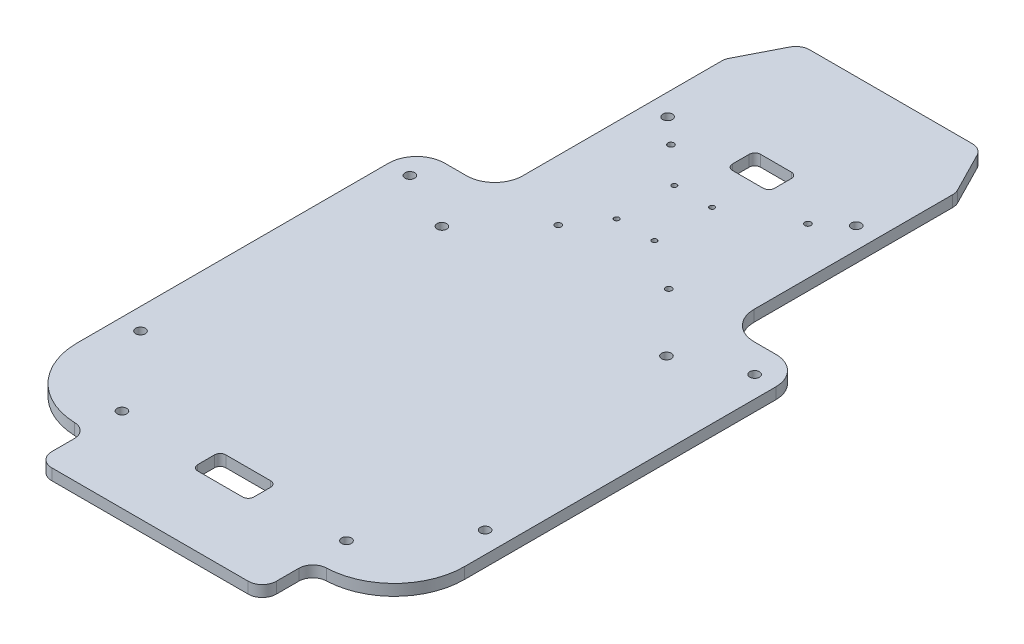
ISO-10303-21;
HEADER;
FILE_DESCRIPTION(('STEP AP214'),'2;1');
FILE_NAME('part.step','',(''),(''),'','','');
FILE_SCHEMA(('AUTOMOTIVE_DESIGN { 1 0 10303 214 1 1 1 1 }'));
ENDSEC;
DATA;
#1=APPLICATION_CONTEXT('core data for automotive mechanical design processes');
#2=APPLICATION_PROTOCOL_DEFINITION('international standard','automotive_design',2000,#1);
#3=PRODUCT_CONTEXT('',#1,'mechanical');
#4=PRODUCT('Part','Part','',(#3));
#5=PRODUCT_RELATED_PRODUCT_CATEGORY('part','',(#4));
#6=PRODUCT_DEFINITION_FORMATION('','',#4);
#7=PRODUCT_DEFINITION_CONTEXT('part definition',#1,'design');
#8=PRODUCT_DEFINITION('design','',#6,#7);
#9=PRODUCT_DEFINITION_SHAPE('','',#8);
#10=(LENGTH_UNIT() NAMED_UNIT(*) SI_UNIT(.MILLI.,.METRE.));
#11=(NAMED_UNIT(*) PLANE_ANGLE_UNIT() SI_UNIT($,.RADIAN.));
#12=(NAMED_UNIT(*) SI_UNIT($,.STERADIAN.) SOLID_ANGLE_UNIT());
#13=UNCERTAINTY_MEASURE_WITH_UNIT(LENGTH_MEASURE(1.E-05),#10,'distance_accuracy_value','');
#14=(GEOMETRIC_REPRESENTATION_CONTEXT(3) GLOBAL_UNCERTAINTY_ASSIGNED_CONTEXT((#13)) GLOBAL_UNIT_ASSIGNED_CONTEXT((#10,
#11,#12)) REPRESENTATION_CONTEXT('',''));
#15=CARTESIAN_POINT('',(0.,0.,0.));
#16=DIRECTION('',(0.,0.,1.));
#17=DIRECTION('',(1.,0.,0.));
#18=AXIS2_PLACEMENT_3D('',#15,#16,#17);
#19=CARTESIAN_POINT('',(0.,5.08,0.));
#20=DIRECTION('',(0.,1.,0.));
#21=DIRECTION('',(0.,0.,1.));
#22=AXIS2_PLACEMENT_3D('',#19,#20,#21);
#23=PLANE('',#22);
#24=CARTESIAN_POINT('',(-14.224,5.08,-202.49896));
#25=DIRECTION('',(0.,1.,0.));
#26=DIRECTION('',(0.,0.,1.));
#27=AXIS2_PLACEMENT_3D('',#24,#25,#26);
#28=CIRCLE('',#27,1.13030000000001);
#29=CARTESIAN_POINT('',(-14.224,5.08,-201.36866));
#30=VERTEX_POINT('',#29);
#31=EDGE_CURVE('E1491',#30,#30,#28,.T.);
#32=ORIENTED_EDGE('',*,*,#31,.F.);
#33=EDGE_LOOP('',(#32));
#34=FACE_BOUND('',#33,.T.);
#35=CARTESIAN_POINT('',(2.87528,5.08,-202.49896));
#36=DIRECTION('',(0.,1.,0.));
#37=DIRECTION('',(0.,0.,1.));
#38=AXIS2_PLACEMENT_3D('',#35,#36,#37);
#39=CIRCLE('',#38,1.13030000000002);
#40=CARTESIAN_POINT('',(2.87528,5.08,-201.36866));
#41=VERTEX_POINT('',#40);
#42=EDGE_CURVE('E1497',#41,#41,#39,.T.);
#43=ORIENTED_EDGE('',*,*,#42,.F.);
#44=EDGE_LOOP('',(#43));
#45=FACE_BOUND('',#44,.T.);
#46=CARTESIAN_POINT('',(2.87528,5.08,-228.6));
#47=DIRECTION('',(0.,1.,0.));
#48=DIRECTION('',(0.,0.,1.));
#49=AXIS2_PLACEMENT_3D('',#46,#47,#48);
#50=CIRCLE('',#49,1.13030000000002);
#51=CARTESIAN_POINT('',(2.87528,5.08,-227.4697));
#52=VERTEX_POINT('',#51);
#53=EDGE_CURVE('E1503',#52,#52,#50,.T.);
#54=ORIENTED_EDGE('',*,*,#53,.F.);
#55=EDGE_LOOP('',(#54));
#56=FACE_BOUND('',#55,.T.);
#57=CARTESIAN_POINT('',(-14.224,5.08,-228.6));
#58=DIRECTION('',(0.,1.,0.));
#59=DIRECTION('',(0.,0.,1.));
#60=AXIS2_PLACEMENT_3D('',#57,#58,#59);
#61=CIRCLE('',#60,1.13030000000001);
#62=CARTESIAN_POINT('',(-14.224,5.08,-227.4697));
#63=VERTEX_POINT('',#62);
#64=EDGE_CURVE('E1485',#63,#63,#61,.T.);
#65=ORIENTED_EDGE('',*,*,#64,.F.);
#66=EDGE_LOOP('',(#65));
#67=FACE_BOUND('',#66,.T.);
#68=CARTESIAN_POINT('',(30.9999999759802,5.08,-243.84));
#69=DIRECTION('',(0.,-1.,0.));
#70=DIRECTION('',(0.,0.,1.));
#71=AXIS2_PLACEMENT_3D('',#68,#69,#70);
#72=CIRCLE('',#71,1.397);
#73=CARTESIAN_POINT('',(30.9999999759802,5.08,-242.443));
#74=VERTEX_POINT('',#73);
#75=EDGE_CURVE('E1421',#74,#74,#72,.T.);
#76=ORIENTED_EDGE('',*,*,#75,.T.);
#77=EDGE_LOOP('',(#76));
#78=FACE_BOUND('',#77,.T.);
#79=CARTESIAN_POINT('',(25.0000000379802,5.08,-186.839999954));
#80=DIRECTION('',(0.,-1.,0.));
#81=DIRECTION('',(0.,0.,1.));
#82=AXIS2_PLACEMENT_3D('',#79,#80,#81);
#83=CIRCLE('',#82,1.397);
#84=CARTESIAN_POINT('',(25.0000000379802,5.08,-185.442999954));
#85=VERTEX_POINT('',#84);
#86=EDGE_CURVE('E1427',#85,#85,#83,.T.);
#87=ORIENTED_EDGE('',*,*,#86,.T.);
#88=EDGE_LOOP('',(#87));
#89=FACE_BOUND('',#88,.T.);
#90=CARTESIAN_POINT('',(50.7999999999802,5.08,-15.24));
#91=DIRECTION('',(0.,-1.,0.));
#92=DIRECTION('',(0.,0.,1.));
#93=AXIS2_PLACEMENT_3D('',#90,#91,#92);
#94=CIRCLE('',#93,2.1844);
#95=CARTESIAN_POINT('',(50.7999999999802,5.08,-13.0556));
#96=VERTEX_POINT('',#95);
#97=EDGE_CURVE('E1434',#96,#96,#94,.T.);
#98=ORIENTED_EDGE('',*,*,#97,.T.);
#99=EDGE_LOOP('',(#98));
#100=FACE_BOUND('',#99,.T.);
#101=CARTESIAN_POINT('',(50.7999999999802,5.08,-160.02));
#102=DIRECTION('',(0.,-1.,0.));
#103=DIRECTION('',(0.,0.,1.));
#104=AXIS2_PLACEMENT_3D('',#101,#102,#103);
#105=CIRCLE('',#104,2.1844);
#106=CARTESIAN_POINT('',(50.7999999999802,5.08,-157.8356));
#107=VERTEX_POINT('',#106);
#108=EDGE_CURVE('E1420',#107,#107,#105,.T.);
#109=ORIENTED_EDGE('',*,*,#108,.T.);
#110=EDGE_LOOP('',(#109));
#111=FACE_BOUND('',#110,.T.);
#112=CARTESIAN_POINT('',(42.672,5.08,-254.));
#113=DIRECTION('',(0.,-1.,0.));
#114=DIRECTION('',(0.,0.,1.));
#115=AXIS2_PLACEMENT_3D('',#112,#113,#114);
#116=CIRCLE('',#115,2.18440000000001);
#117=CARTESIAN_POINT('',(42.672,5.08,-251.8156));
#118=VERTEX_POINT('',#117);
#119=EDGE_CURVE('E1444',#118,#118,#116,.T.);
#120=ORIENTED_EDGE('',*,*,#119,.T.);
#121=EDGE_LOOP('',(#120));
#122=FACE_BOUND('',#121,.T.);
#123=CARTESIAN_POINT('',(77.978,5.08,-50.8));
#124=DIRECTION('',(0.,-1.,0.));
#125=DIRECTION('',(0.,0.,1.));
#126=AXIS2_PLACEMENT_3D('',#123,#124,#125);
#127=CIRCLE('',#126,2.1844);
#128=CARTESIAN_POINT('',(77.978,5.08,-48.6156));
#129=VERTEX_POINT('',#128);
#130=EDGE_CURVE('E1450',#129,#129,#127,.T.);
#131=ORIENTED_EDGE('',*,*,#130,.T.);
#132=EDGE_LOOP('',(#131));
#133=FACE_BOUND('',#132,.T.);
#134=CARTESIAN_POINT('',(77.978,5.08,-172.72));
#135=DIRECTION('',(0.,-1.,0.));
#136=DIRECTION('',(0.,0.,1.));
#137=AXIS2_PLACEMENT_3D('',#134,#135,#136);
#138=CIRCLE('',#137,2.18439999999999);
#139=CARTESIAN_POINT('',(77.978,5.08,-170.5356));
#140=VERTEX_POINT('',#139);
#141=EDGE_CURVE('E1433',#140,#140,#138,.T.);
#142=ORIENTED_EDGE('',*,*,#141,.T.);
#143=EDGE_LOOP('',(#142));
#144=FACE_BOUND('',#143,.T.);
#145=DIRECTION('',(1.,0.,0.));
#146=VECTOR('',#145,1.);
#147=CARTESIAN_POINT('',(-400000.,5.08,22.860000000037));
#148=LINE('',#147,#146);
#149=CARTESIAN_POINT('',(-44.4499999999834,5.08,22.8599999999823));
#150=VERTEX_POINT('',#149);
#151=CARTESIAN_POINT('',(44.4499999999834,5.08,22.8599999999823));
#152=VERTEX_POINT('',#151);
#153=EDGE_CURVE('E620',#150,#152,#148,.T.);
#154=ORIENTED_EDGE('',*,*,#153,.T.);
#155=CARTESIAN_POINT('',(44.4499999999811,5.08,16.5099999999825));
#156=DIRECTION('',(0.,1.,0.));
#157=DIRECTION('',(0.,0.,1.));
#158=AXIS2_PLACEMENT_3D('',#155,#156,#157);
#159=CIRCLE('',#158,6.35);
#160=CARTESIAN_POINT('',(50.7999999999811,5.08,16.5099999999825));
#161=VERTEX_POINT('',#160);
#162=EDGE_CURVE('E482',#152,#161,#159,.T.);
#163=ORIENTED_EDGE('',*,*,#162,.T.);
#164=DIRECTION('',(0.,0.,1.));
#165=VECTOR('',#164,1.);
#166=CARTESIAN_POINT('',(50.7999999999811,5.08,291270.816));
#167=LINE('',#166,#165);
#168=CARTESIAN_POINT('',(50.7999999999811,5.08,6.32882745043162));
#169=VERTEX_POINT('',#168);
#170=EDGE_CURVE('E700',#169,#161,#167,.T.);
#171=ORIENTED_EDGE('',*,*,#170,.F.);
#172=CARTESIAN_POINT('',(57.1499999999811,5.08,6.32882745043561));
#173=DIRECTION('',(0.,1.,0.));
#174=DIRECTION('',(0.,0.,1.));
#175=AXIS2_PLACEMENT_3D('',#172,#173,#174);
#176=CIRCLE('',#175,6.35);
#177=CARTESIAN_POINT('',(56.9383333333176,5.08,-0.0176437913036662));
#178=VERTEX_POINT('',#177);
#179=EDGE_CURVE('E489',#169,#178,#176,.F.);
#180=ORIENTED_EDGE('',*,*,#179,.T.);
#181=CARTESIAN_POINT('',(55.88,5.08,-31.75));
#182=DIRECTION('',(0.,1.,0.));
#183=DIRECTION('',(0.,0.,1.));
#184=AXIS2_PLACEMENT_3D('',#181,#182,#183);
#185=CIRCLE('',#184,31.75);
#186=CARTESIAN_POINT('',(87.63,5.08,-31.7500000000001));
#187=VERTEX_POINT('',#186);
#188=EDGE_CURVE('E434',#178,#187,#185,.T.);
#189=ORIENTED_EDGE('',*,*,#188,.T.);
#190=DIRECTION('',(0.,0.,1.));
#191=VECTOR('',#190,1.);
#192=CARTESIAN_POINT('',(87.63,5.08,-185.42));
#193=LINE('',#192,#191);
#194=CARTESIAN_POINT('',(87.63,5.08,-172.72));
#195=VERTEX_POINT('',#194);
#196=EDGE_CURVE('E709',#195,#187,#193,.T.);
#197=ORIENTED_EDGE('',*,*,#196,.F.);
#198=CARTESIAN_POINT('',(74.93,5.08,-172.72));
#199=DIRECTION('',(0.,1.,0.));
#200=DIRECTION('',(0.,0.,1.));
#201=AXIS2_PLACEMENT_3D('',#198,#199,#200);
#202=CIRCLE('',#201,12.7);
#203=CARTESIAN_POINT('',(74.93,5.08,-185.42));
#204=VERTEX_POINT('',#203);
#205=EDGE_CURVE('E448',#195,#204,#202,.T.);
#206=ORIENTED_EDGE('',*,*,#205,.T.);
#207=DIRECTION('',(1.,0.,0.));
#208=VECTOR('',#207,1.);
#209=CARTESIAN_POINT('',(52.324,5.08,-185.42));
#210=LINE('',#209,#208);
#211=CARTESIAN_POINT('',(65.024,5.08,-185.42));
#212=VERTEX_POINT('',#211);
#213=EDGE_CURVE('E712',#212,#204,#210,.T.);
#214=ORIENTED_EDGE('',*,*,#213,.F.);
#215=CARTESIAN_POINT('',(65.024,5.08,-198.12));
#216=DIRECTION('',(0.,1.,0.));
#217=DIRECTION('',(0.,0.,1.));
#218=AXIS2_PLACEMENT_3D('',#215,#216,#217);
#219=CIRCLE('',#218,12.7);
#220=CARTESIAN_POINT('',(52.324,5.08,-198.12));
#221=VERTEX_POINT('',#220);
#222=EDGE_CURVE('E452',#212,#221,#219,.F.);
#223=ORIENTED_EDGE('',*,*,#222,.T.);
#224=DIRECTION('',(0.,0.,1.));
#225=VECTOR('',#224,1.);
#226=CARTESIAN_POINT('',(52.324,5.08,-289.56));
#227=LINE('',#226,#225);
#228=CARTESIAN_POINT('',(52.324,5.08,-288.031274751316));
#229=VERTEX_POINT('',#228);
#230=EDGE_CURVE('E570',#229,#221,#227,.T.);
#231=ORIENTED_EDGE('',*,*,#230,.F.);
#232=CARTESIAN_POINT('',(45.974,5.08,-288.031274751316));
#233=DIRECTION('',(0.,1.,0.));
#234=DIRECTION('',(0.,0.,1.));
#235=AXIS2_PLACEMENT_3D('',#232,#233,#234);
#236=CIRCLE('',#235,6.35);
#237=CARTESIAN_POINT('',(51.6282602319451,5.08,-290.921229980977));
#238=VERTEX_POINT('',#237);
#239=EDGE_CURVE('E461',#229,#238,#236,.T.);
#240=ORIENTED_EDGE('',*,*,#239,.T.);
#241=DIRECTION('',(0.455111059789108,0.,0.890434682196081));
#242=VECTOR('',#241,1.);
#243=CARTESIAN_POINT('',(52.324,5.08,-289.56));
#244=LINE('',#243,#242);
#245=CARTESIAN_POINT('',(42.4084673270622,5.08,-308.959955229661));
#246=VERTEX_POINT('',#245);
#247=EDGE_CURVE('E695',#246,#238,#244,.T.);
#248=ORIENTED_EDGE('',*,*,#247,.F.);
#249=CARTESIAN_POINT('',(36.7542070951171,5.08,-306.07));
#250=DIRECTION('',(0.,1.,0.));
#251=DIRECTION('',(0.,0.,1.));
#252=AXIS2_PLACEMENT_3D('',#249,#250,#251);
#253=CIRCLE('',#252,6.35);
#254=CARTESIAN_POINT('',(36.7542070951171,5.08,-312.42));
#255=VERTEX_POINT('',#254);
#256=EDGE_CURVE('E463',#246,#255,#253,.T.);
#257=ORIENTED_EDGE('',*,*,#256,.T.);
#258=DIRECTION('',(-1.,0.,0.));
#259=VECTOR('',#258,1.);
#260=CARTESIAN_POINT('',(-40.64,5.08,-312.42));
#261=LINE('',#260,#259);
#262=CARTESIAN_POINT('',(-36.7542070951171,5.08,-312.42));
#263=VERTEX_POINT('',#262);
#264=EDGE_CURVE('E624',#255,#263,#261,.T.);
#265=ORIENTED_EDGE('',*,*,#264,.T.);
#266=CARTESIAN_POINT('',(-36.7542070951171,5.08,-306.07));
#267=DIRECTION('',(0.,1.,0.));
#268=DIRECTION('',(0.,0.,1.));
#269=AXIS2_PLACEMENT_3D('',#266,#267,#268);
#270=CIRCLE('',#269,6.35);
#271=CARTESIAN_POINT('',(-42.4084673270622,5.08,-308.959955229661));
#272=VERTEX_POINT('',#271);
#273=EDGE_CURVE('E357',#263,#272,#270,.T.);
#274=ORIENTED_EDGE('',*,*,#273,.T.);
#275=DIRECTION('',(-0.455111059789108,0.,0.890434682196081));
#276=VECTOR('',#275,1.);
#277=CARTESIAN_POINT('',(-52.324,5.08,-289.56));
#278=LINE('',#277,#276);
#279=CARTESIAN_POINT('',(-51.6282602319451,5.08,-290.921229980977));
#280=VERTEX_POINT('',#279);
#281=EDGE_CURVE('E632',#272,#280,#278,.T.);
#282=ORIENTED_EDGE('',*,*,#281,.T.);
#283=CARTESIAN_POINT('',(-45.974,5.08,-288.031274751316));
#284=DIRECTION('',(0.,1.,0.));
#285=DIRECTION('',(0.,0.,1.));
#286=AXIS2_PLACEMENT_3D('',#283,#284,#285);
#287=CIRCLE('',#286,6.35);
#288=CARTESIAN_POINT('',(-52.324,5.08,-288.031274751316));
#289=VERTEX_POINT('',#288);
#290=EDGE_CURVE('E355',#280,#289,#287,.T.);
#291=ORIENTED_EDGE('',*,*,#290,.T.);
#292=DIRECTION('',(0.,0.,1.));
#293=VECTOR('',#292,1.);
#294=CARTESIAN_POINT('',(-52.324,5.08,-289.56));
#295=LINE('',#294,#293);
#296=CARTESIAN_POINT('',(-52.324,5.08,-198.12));
#297=VERTEX_POINT('',#296);
#298=EDGE_CURVE('E325',#289,#297,#295,.T.);
#299=ORIENTED_EDGE('',*,*,#298,.T.);
#300=CARTESIAN_POINT('',(-65.024,5.08,-198.12));
#301=DIRECTION('',(0.,1.,0.));
#302=DIRECTION('',(0.,0.,1.));
#303=AXIS2_PLACEMENT_3D('',#300,#301,#302);
#304=CIRCLE('',#303,12.7);
#305=CARTESIAN_POINT('',(-65.024,5.08,-185.42));
#306=VERTEX_POINT('',#305);
#307=EDGE_CURVE('E350',#297,#306,#304,.F.);
#308=ORIENTED_EDGE('',*,*,#307,.T.);
#309=DIRECTION('',(-1.,0.,0.));
#310=VECTOR('',#309,1.);
#311=CARTESIAN_POINT('',(-52.324,5.08,-185.42));
#312=LINE('',#311,#310);
#313=CARTESIAN_POINT('',(-74.93,5.08,-185.42));
#314=VERTEX_POINT('',#313);
#315=EDGE_CURVE('E640',#306,#314,#312,.T.);
#316=ORIENTED_EDGE('',*,*,#315,.T.);
#317=CARTESIAN_POINT('',(-74.93,5.08,-172.72));
#318=DIRECTION('',(0.,1.,0.));
#319=DIRECTION('',(0.,0.,1.));
#320=AXIS2_PLACEMENT_3D('',#317,#318,#319);
#321=CIRCLE('',#320,12.7);
#322=CARTESIAN_POINT('',(-87.63,5.08,-172.72));
#323=VERTEX_POINT('',#322);
#324=EDGE_CURVE('E345',#314,#323,#321,.T.);
#325=ORIENTED_EDGE('',*,*,#324,.T.);
#326=DIRECTION('',(0.,0.,1.));
#327=VECTOR('',#326,1.);
#328=CARTESIAN_POINT('',(-87.63,5.08,-185.42));
#329=LINE('',#328,#327);
#330=CARTESIAN_POINT('',(-87.63,5.08,-31.7500000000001));
#331=VERTEX_POINT('',#330);
#332=EDGE_CURVE('E315',#323,#331,#329,.T.);
#333=ORIENTED_EDGE('',*,*,#332,.T.);
#334=CARTESIAN_POINT('',(-55.88,5.08,-31.75));
#335=DIRECTION('',(0.,1.,0.));
#336=DIRECTION('',(0.,0.,1.));
#337=AXIS2_PLACEMENT_3D('',#334,#335,#336);
#338=CIRCLE('',#337,31.75);
#339=CARTESIAN_POINT('',(-56.9383333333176,5.08,-0.0176437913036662));
#340=VERTEX_POINT('',#339);
#341=EDGE_CURVE('E330',#331,#340,#338,.T.);
#342=ORIENTED_EDGE('',*,*,#341,.T.);
#343=CARTESIAN_POINT('',(-57.1499999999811,5.08,6.32882745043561));
#344=DIRECTION('',(0.,1.,0.));
#345=DIRECTION('',(0.,0.,1.));
#346=AXIS2_PLACEMENT_3D('',#343,#344,#345);
#347=CIRCLE('',#346,6.35);
#348=CARTESIAN_POINT('',(-50.7999999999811,5.08,6.32882745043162));
#349=VERTEX_POINT('',#348);
#350=EDGE_CURVE('E386',#340,#349,#347,.F.);
#351=ORIENTED_EDGE('',*,*,#350,.T.);
#352=DIRECTION('',(0.,0.,1.));
#353=VECTOR('',#352,1.);
#354=CARTESIAN_POINT('',(-50.7999999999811,5.08,291270.689));
#355=LINE('',#354,#353);
#356=CARTESIAN_POINT('',(-50.7999999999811,5.08,16.5099999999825));
#357=VERTEX_POINT('',#356);
#358=EDGE_CURVE('E617',#349,#357,#355,.T.);
#359=ORIENTED_EDGE('',*,*,#358,.T.);
#360=CARTESIAN_POINT('',(-44.4499999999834,5.08,16.5099999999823));
#361=DIRECTION('',(0.,1.,0.));
#362=DIRECTION('',(0.,0.,1.));
#363=AXIS2_PLACEMENT_3D('',#360,#361,#362);
#364=CIRCLE('',#363,6.35);
#365=EDGE_CURVE('E381',#357,#150,#364,.T.);
#366=ORIENTED_EDGE('',*,*,#365,.T.);
#367=EDGE_LOOP('',(#154,#163,#171,#180,#189,#197,#206,#214,#223,#231,#240,#248,#257,#265,#274,
#282,#291,#299,#308,#316,#325,#333,#342,#351,#359,#366));
#368=FACE_BOUND('',#367,.T.);
#369=CARTESIAN_POINT('',(-30.9999999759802,5.08,-243.84));
#370=DIRECTION('',(0.,1.,0.));
#371=DIRECTION('',(0.,0.,1.));
#372=AXIS2_PLACEMENT_3D('',#369,#370,#371);
#373=CIRCLE('',#372,1.397);
#374=CARTESIAN_POINT('',(-30.9999999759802,5.08,-242.443));
#375=VERTEX_POINT('',#374);
#376=EDGE_CURVE('E579',#375,#375,#373,.T.);
#377=ORIENTED_EDGE('',*,*,#376,.F.);
#378=EDGE_LOOP('',(#377));
#379=FACE_BOUND('',#378,.T.);
#380=CARTESIAN_POINT('',(-25.0000000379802,5.08,-186.839999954));
#381=DIRECTION('',(0.,1.,0.));
#382=DIRECTION('',(0.,0.,1.));
#383=AXIS2_PLACEMENT_3D('',#380,#381,#382);
#384=CIRCLE('',#383,1.397);
#385=CARTESIAN_POINT('',(-25.0000000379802,5.08,-185.442999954));
#386=VERTEX_POINT('',#385);
#387=EDGE_CURVE('E554',#386,#386,#384,.T.);
#388=ORIENTED_EDGE('',*,*,#387,.F.);
#389=EDGE_LOOP('',(#388));
#390=FACE_BOUND('',#389,.T.);
#391=CARTESIAN_POINT('',(-50.7999999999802,5.08,-15.24));
#392=DIRECTION('',(0.,1.,0.));
#393=DIRECTION('',(0.,0.,1.));
#394=AXIS2_PLACEMENT_3D('',#391,#392,#393);
#395=CIRCLE('',#394,2.1844);
#396=CARTESIAN_POINT('',(-50.7999999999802,5.08,-13.0556));
#397=VERTEX_POINT('',#396);
#398=EDGE_CURVE('E591',#397,#397,#395,.T.);
#399=ORIENTED_EDGE('',*,*,#398,.F.);
#400=EDGE_LOOP('',(#399));
#401=FACE_BOUND('',#400,.T.);
#402=CARTESIAN_POINT('',(-50.7999999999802,5.08,-160.02));
#403=DIRECTION('',(0.,1.,0.));
#404=DIRECTION('',(0.,0.,1.));
#405=AXIS2_PLACEMENT_3D('',#402,#403,#404);
#406=CIRCLE('',#405,2.1844);
#407=CARTESIAN_POINT('',(-50.7999999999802,5.08,-157.8356));
#408=VERTEX_POINT('',#407);
#409=EDGE_CURVE('E578',#408,#408,#406,.T.);
#410=ORIENTED_EDGE('',*,*,#409,.F.);
#411=EDGE_LOOP('',(#410));
#412=FACE_BOUND('',#411,.T.);
#413=CARTESIAN_POINT('',(-42.672,5.08,-254.));
#414=DIRECTION('',(0.,1.,0.));
#415=DIRECTION('',(0.,0.,1.));
#416=AXIS2_PLACEMENT_3D('',#413,#414,#415);
#417=CIRCLE('',#416,2.18440000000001);
#418=CARTESIAN_POINT('',(-42.672,5.08,-251.8156));
#419=VERTEX_POINT('',#418);
#420=EDGE_CURVE('E603',#419,#419,#417,.T.);
#421=ORIENTED_EDGE('',*,*,#420,.F.);
#422=EDGE_LOOP('',(#421));
#423=FACE_BOUND('',#422,.T.);
#424=CARTESIAN_POINT('',(-77.978,5.08,-50.8));
#425=DIRECTION('',(0.,1.,0.));
#426=DIRECTION('',(0.,0.,1.));
#427=AXIS2_PLACEMENT_3D('',#424,#425,#426);
#428=CIRCLE('',#427,2.1844);
#429=CARTESIAN_POINT('',(-77.978,5.08,-48.6156));
#430=VERTEX_POINT('',#429);
#431=EDGE_CURVE('E609',#430,#430,#428,.T.);
#432=ORIENTED_EDGE('',*,*,#431,.F.);
#433=EDGE_LOOP('',(#432));
#434=FACE_BOUND('',#433,.T.);
#435=CARTESIAN_POINT('',(-77.978,5.08,-172.72));
#436=DIRECTION('',(0.,1.,0.));
#437=DIRECTION('',(0.,0.,1.));
#438=AXIS2_PLACEMENT_3D('',#435,#436,#437);
#439=CIRCLE('',#438,2.18439999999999);
#440=CARTESIAN_POINT('',(-77.978,5.08,-170.5356));
#441=VERTEX_POINT('',#440);
#442=EDGE_CURVE('E590',#441,#441,#439,.T.);
#443=ORIENTED_EDGE('',*,*,#442,.F.);
#444=EDGE_LOOP('',(#443));
#445=FACE_BOUND('',#444,.T.);
#446=DIRECTION('',(-1.,0.,0.));
#447=VECTOR('',#446,1.);
#448=CARTESIAN_POINT('',(-9.52499999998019,5.08,-260.35));
#449=LINE('',#448,#447);
#450=CARTESIAN_POINT('',(6.98499999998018,5.08,-260.35));
#451=VERTEX_POINT('',#450);
#452=CARTESIAN_POINT('',(-6.98499999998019,5.08,-260.35));
#453=VERTEX_POINT('',#452);
#454=EDGE_CURVE('E567',#451,#453,#449,.T.);
#455=ORIENTED_EDGE('',*,*,#454,.F.);
#456=CARTESIAN_POINT('',(6.98499999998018,5.08,-257.81));
#457=DIRECTION('',(0.,1.,0.));
#458=DIRECTION('',(0.,0.,1.));
#459=AXIS2_PLACEMENT_3D('',#456,#457,#458);
#460=CIRCLE('',#459,2.54);
#461=CARTESIAN_POINT('',(9.52499999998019,5.08,-257.81));
#462=VERTEX_POINT('',#461);
#463=EDGE_CURVE('E514',#451,#462,#460,.F.);
#464=ORIENTED_EDGE('',*,*,#463,.T.);
#465=DIRECTION('',(0.,0.,1.));
#466=VECTOR('',#465,1.);
#467=CARTESIAN_POINT('',(9.52499999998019,5.08,-260.35));
#468=LINE('',#467,#466);
#469=CARTESIAN_POINT('',(9.52499999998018,5.08,-250.19));
#470=VERTEX_POINT('',#469);
#471=EDGE_CURVE('E1411',#462,#470,#468,.T.);
#472=ORIENTED_EDGE('',*,*,#471,.T.);
#473=CARTESIAN_POINT('',(6.98499999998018,5.08,-250.19));
#474=DIRECTION('',(0.,1.,0.));
#475=DIRECTION('',(0.,0.,1.));
#476=AXIS2_PLACEMENT_3D('',#473,#474,#475);
#477=CIRCLE('',#476,2.54);
#478=CARTESIAN_POINT('',(6.98499999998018,5.08,-247.65));
#479=VERTEX_POINT('',#478);
#480=EDGE_CURVE('E510',#470,#479,#477,.F.);
#481=ORIENTED_EDGE('',*,*,#480,.T.);
#482=DIRECTION('',(1.,0.,0.));
#483=VECTOR('',#482,1.);
#484=CARTESIAN_POINT('',(-9.52499999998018,5.08,-247.65));
#485=LINE('',#484,#483);
#486=CARTESIAN_POINT('',(-6.98499999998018,5.08,-247.65));
#487=VERTEX_POINT('',#486);
#488=EDGE_CURVE('E562',#487,#479,#485,.T.);
#489=ORIENTED_EDGE('',*,*,#488,.F.);
#490=CARTESIAN_POINT('',(-6.98499999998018,5.08,-250.19));
#491=DIRECTION('',(0.,1.,0.));
#492=DIRECTION('',(0.,0.,1.));
#493=AXIS2_PLACEMENT_3D('',#490,#491,#492);
#494=CIRCLE('',#493,2.54);
#495=CARTESIAN_POINT('',(-9.52499999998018,5.08,-250.19));
#496=VERTEX_POINT('',#495);
#497=EDGE_CURVE('E410',#487,#496,#494,.F.);
#498=ORIENTED_EDGE('',*,*,#497,.T.);
#499=DIRECTION('',(0.,0.,1.));
#500=VECTOR('',#499,1.);
#501=CARTESIAN_POINT('',(-9.52499999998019,5.08,-260.35));
#502=LINE('',#501,#500);
#503=CARTESIAN_POINT('',(-9.52499999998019,5.08,-257.81));
#504=VERTEX_POINT('',#503);
#505=EDGE_CURVE('E569',#504,#496,#502,.T.);
#506=ORIENTED_EDGE('',*,*,#505,.F.);
#507=CARTESIAN_POINT('',(-6.98499999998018,5.08,-257.81));
#508=DIRECTION('',(0.,1.,0.));
#509=DIRECTION('',(0.,0.,1.));
#510=AXIS2_PLACEMENT_3D('',#507,#508,#509);
#511=CIRCLE('',#510,2.54);
#512=EDGE_CURVE('E414',#504,#453,#511,.F.);
#513=ORIENTED_EDGE('',*,*,#512,.T.);
#514=EDGE_LOOP('',(#455,#464,#472,#481,#489,#498,#506,#513));
#515=FACE_BOUND('',#514,.T.);
#516=DIRECTION('',(-1.,0.,0.));
#517=VECTOR('',#516,1.);
#518=CARTESIAN_POINT('',(-12.6999999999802,5.08,-21.59));
#519=LINE('',#518,#517);
#520=CARTESIAN_POINT('',(10.1599999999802,5.08,-21.59));
#521=VERTEX_POINT('',#520);
#522=CARTESIAN_POINT('',(-10.1599999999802,5.08,-21.59));
#523=VERTEX_POINT('',#522);
#524=EDGE_CURVE('E526',#521,#523,#519,.T.);
#525=ORIENTED_EDGE('',*,*,#524,.F.);
#526=CARTESIAN_POINT('',(10.1599999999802,5.08,-19.05));
#527=DIRECTION('',(0.,1.,0.));
#528=DIRECTION('',(0.,0.,1.));
#529=AXIS2_PLACEMENT_3D('',#526,#527,#528);
#530=CIRCLE('',#529,2.54);
#531=CARTESIAN_POINT('',(12.6999999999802,5.08,-19.05));
#532=VERTEX_POINT('',#531);
#533=EDGE_CURVE('E43',#521,#532,#530,.F.);
#534=ORIENTED_EDGE('',*,*,#533,.T.);
#535=DIRECTION('',(0.,0.,1.));
#536=VECTOR('',#535,1.);
#537=CARTESIAN_POINT('',(12.6999999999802,5.08,-21.59));
#538=LINE('',#537,#536);
#539=CARTESIAN_POINT('',(12.6999999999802,5.08,-11.43));
#540=VERTEX_POINT('',#539);
#541=EDGE_CURVE('E525',#532,#540,#538,.T.);
#542=ORIENTED_EDGE('',*,*,#541,.T.);
#543=CARTESIAN_POINT('',(10.1599999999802,5.08,-11.43));
#544=DIRECTION('',(0.,1.,0.));
#545=DIRECTION('',(0.,0.,1.));
#546=AXIS2_PLACEMENT_3D('',#543,#544,#545);
#547=CIRCLE('',#546,2.54);
#548=CARTESIAN_POINT('',(10.1599999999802,5.08,-8.89));
#549=VERTEX_POINT('',#548);
#550=EDGE_CURVE('E518',#540,#549,#547,.F.);
#551=ORIENTED_EDGE('',*,*,#550,.T.);
#552=DIRECTION('',(1.,0.,0.));
#553=VECTOR('',#552,1.);
#554=CARTESIAN_POINT('',(-12.6999999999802,5.08,-8.89));
#555=LINE('',#554,#553);
#556=CARTESIAN_POINT('',(-10.1599999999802,5.08,-8.89));
#557=VERTEX_POINT('',#556);
#558=EDGE_CURVE('E540',#557,#549,#555,.T.);
#559=ORIENTED_EDGE('',*,*,#558,.F.);
#560=CARTESIAN_POINT('',(-10.1599999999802,5.08,-11.43));
#561=DIRECTION('',(0.,1.,0.));
#562=DIRECTION('',(0.,0.,1.));
#563=AXIS2_PLACEMENT_3D('',#560,#561,#562);
#564=CIRCLE('',#563,2.54);
#565=CARTESIAN_POINT('',(-12.6999999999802,5.08,-11.43));
#566=VERTEX_POINT('',#565);
#567=EDGE_CURVE('E419',#557,#566,#564,.F.);
#568=ORIENTED_EDGE('',*,*,#567,.T.);
#569=DIRECTION('',(0.,0.,1.));
#570=VECTOR('',#569,1.);
#571=CARTESIAN_POINT('',(-12.6999999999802,5.08,-21.59));
#572=LINE('',#571,#570);
#573=CARTESIAN_POINT('',(-12.6999999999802,5.08,-19.05));
#574=VERTEX_POINT('',#573);
#575=EDGE_CURVE('E546',#574,#566,#572,.T.);
#576=ORIENTED_EDGE('',*,*,#575,.F.);
#577=CARTESIAN_POINT('',(-10.1599999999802,5.08,-19.05));
#578=DIRECTION('',(0.,1.,0.));
#579=DIRECTION('',(0.,0.,1.));
#580=AXIS2_PLACEMENT_3D('',#577,#578,#579);
#581=CIRCLE('',#580,2.54);
#582=EDGE_CURVE('E423',#574,#523,#581,.F.);
#583=ORIENTED_EDGE('',*,*,#582,.T.);
#584=EDGE_LOOP('',(#525,#534,#542,#551,#559,#568,#576,#583));
#585=FACE_BOUND('',#584,.T.);
#586=ADVANCED_FACE('F35',(#34,#45,#56,#67,#78,#89,#100,#111,#122,#133,#144,#368,#379,#390,#401,
#412,#423,#434,#445,#515,#585),#23,.T.);
#587=CARTESIAN_POINT('',(0.,0.,0.));
#588=DIRECTION('',(0.,1.,0.));
#589=DIRECTION('',(0.,0.,1.));
#590=AXIS2_PLACEMENT_3D('',#587,#588,#589);
#591=PLANE('',#590);
#592=CARTESIAN_POINT('',(-14.224,0.,-202.49896));
#593=DIRECTION('',(0.,1.,0.));
#594=DIRECTION('',(0.,0.,1.));
#595=AXIS2_PLACEMENT_3D('',#592,#593,#594);
#596=CIRCLE('',#595,1.13030000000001);
#597=CARTESIAN_POINT('',(-14.224,0.,-201.36866));
#598=VERTEX_POINT('',#597);
#599=EDGE_CURVE('E1494',#598,#598,#596,.T.);
#600=ORIENTED_EDGE('',*,*,#599,.T.);
#601=EDGE_LOOP('',(#600));
#602=FACE_BOUND('',#601,.T.);
#603=CARTESIAN_POINT('',(2.87528,0.,-202.49896));
#604=DIRECTION('',(0.,1.,0.));
#605=DIRECTION('',(0.,0.,1.));
#606=AXIS2_PLACEMENT_3D('',#603,#604,#605);
#607=CIRCLE('',#606,1.13030000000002);
#608=CARTESIAN_POINT('',(2.87528,0.,-201.36866));
#609=VERTEX_POINT('',#608);
#610=EDGE_CURVE('E1500',#609,#609,#607,.T.);
#611=ORIENTED_EDGE('',*,*,#610,.T.);
#612=EDGE_LOOP('',(#611));
#613=FACE_BOUND('',#612,.T.);
#614=CARTESIAN_POINT('',(2.87528,0.,-228.6));
#615=DIRECTION('',(0.,1.,0.));
#616=DIRECTION('',(0.,0.,1.));
#617=AXIS2_PLACEMENT_3D('',#614,#615,#616);
#618=CIRCLE('',#617,1.13030000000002);
#619=CARTESIAN_POINT('',(2.87528,0.,-227.4697));
#620=VERTEX_POINT('',#619);
#621=EDGE_CURVE('E1488',#620,#620,#618,.T.);
#622=ORIENTED_EDGE('',*,*,#621,.T.);
#623=EDGE_LOOP('',(#622));
#624=FACE_BOUND('',#623,.T.);
#625=CARTESIAN_POINT('',(-14.224,0.,-228.6));
#626=DIRECTION('',(0.,1.,0.));
#627=DIRECTION('',(0.,0.,1.));
#628=AXIS2_PLACEMENT_3D('',#625,#626,#627);
#629=CIRCLE('',#628,1.13030000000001);
#630=CARTESIAN_POINT('',(-14.224,0.,-227.4697));
#631=VERTEX_POINT('',#630);
#632=EDGE_CURVE('E1413',#631,#631,#629,.T.);
#633=ORIENTED_EDGE('',*,*,#632,.T.);
#634=EDGE_LOOP('',(#633));
#635=FACE_BOUND('',#634,.T.);
#636=DIRECTION('',(0.,0.,1.));
#637=VECTOR('',#636,1.);
#638=CARTESIAN_POINT('',(9.52499999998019,0.,-260.35));
#639=LINE('',#638,#637);
#640=CARTESIAN_POINT('',(9.52499999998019,0.,-257.81));
#641=VERTEX_POINT('',#640);
#642=CARTESIAN_POINT('',(9.52499999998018,0.,-250.19));
#643=VERTEX_POINT('',#642);
#644=EDGE_CURVE('E532',#641,#643,#639,.T.);
#645=ORIENTED_EDGE('',*,*,#644,.F.);
#646=CARTESIAN_POINT('',(6.98499999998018,0.,-257.81));
#647=DIRECTION('',(0.,1.,0.));
#648=DIRECTION('',(0.,0.,1.));
#649=AXIS2_PLACEMENT_3D('',#646,#647,#648);
#650=CIRCLE('',#649,2.54);
#651=CARTESIAN_POINT('',(6.98499999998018,0.,-260.35));
#652=VERTEX_POINT('',#651);
#653=EDGE_CURVE('E516',#641,#652,#650,.T.);
#654=ORIENTED_EDGE('',*,*,#653,.T.);
#655=DIRECTION('',(-1.,0.,0.));
#656=VECTOR('',#655,1.);
#657=CARTESIAN_POINT('',(-9.52499999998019,0.,-260.35));
#658=LINE('',#657,#656);
#659=CARTESIAN_POINT('',(-6.98499999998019,0.,-260.35));
#660=VERTEX_POINT('',#659);
#661=EDGE_CURVE('E559',#652,#660,#658,.T.);
#662=ORIENTED_EDGE('',*,*,#661,.T.);
#663=CARTESIAN_POINT('',(-6.98499999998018,0.,-257.81));
#664=DIRECTION('',(0.,1.,0.));
#665=DIRECTION('',(0.,0.,1.));
#666=AXIS2_PLACEMENT_3D('',#663,#664,#665);
#667=CIRCLE('',#666,2.54);
#668=CARTESIAN_POINT('',(-9.52499999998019,0.,-257.81));
#669=VERTEX_POINT('',#668);
#670=EDGE_CURVE('E417',#660,#669,#667,.T.);
#671=ORIENTED_EDGE('',*,*,#670,.T.);
#672=DIRECTION('',(0.,0.,1.));
#673=VECTOR('',#672,1.);
#674=CARTESIAN_POINT('',(-9.52499999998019,0.,-260.35));
#675=LINE('',#674,#673);
#676=CARTESIAN_POINT('',(-9.52499999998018,0.,-250.19));
#677=VERTEX_POINT('',#676);
#678=EDGE_CURVE('E561',#669,#677,#675,.T.);
#679=ORIENTED_EDGE('',*,*,#678,.T.);
#680=CARTESIAN_POINT('',(-6.98499999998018,0.,-250.19));
#681=DIRECTION('',(0.,1.,0.));
#682=DIRECTION('',(0.,0.,1.));
#683=AXIS2_PLACEMENT_3D('',#680,#681,#682);
#684=CIRCLE('',#683,2.54);
#685=CARTESIAN_POINT('',(-6.98499999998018,0.,-247.65));
#686=VERTEX_POINT('',#685);
#687=EDGE_CURVE('E412',#677,#686,#684,.T.);
#688=ORIENTED_EDGE('',*,*,#687,.T.);
#689=DIRECTION('',(1.,0.,0.));
#690=VECTOR('',#689,1.);
#691=CARTESIAN_POINT('',(-9.52499999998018,0.,-247.65));
#692=LINE('',#691,#690);
#693=CARTESIAN_POINT('',(6.98499999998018,0.,-247.65));
#694=VERTEX_POINT('',#693);
#695=EDGE_CURVE('E556',#686,#694,#692,.T.);
#696=ORIENTED_EDGE('',*,*,#695,.T.);
#697=CARTESIAN_POINT('',(6.98499999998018,0.,-250.19));
#698=DIRECTION('',(0.,1.,0.));
#699=DIRECTION('',(0.,0.,1.));
#700=AXIS2_PLACEMENT_3D('',#697,#698,#699);
#701=CIRCLE('',#700,2.54);
#702=EDGE_CURVE('E512',#694,#643,#701,.T.);
#703=ORIENTED_EDGE('',*,*,#702,.T.);
#704=EDGE_LOOP('',(#645,#654,#662,#671,#679,#688,#696,#703));
#705=FACE_BOUND('',#704,.T.);
#706=CARTESIAN_POINT('',(30.9999999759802,0.,-243.84));
#707=DIRECTION('',(0.,-1.,0.));
#708=DIRECTION('',(0.,0.,1.));
#709=AXIS2_PLACEMENT_3D('',#706,#707,#708);
#710=CIRCLE('',#709,1.397);
#711=CARTESIAN_POINT('',(30.9999999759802,0.,-242.443));
#712=VERTEX_POINT('',#711);
#713=EDGE_CURVE('E1417',#712,#712,#710,.T.);
#714=ORIENTED_EDGE('',*,*,#713,.F.);
#715=EDGE_LOOP('',(#714));
#716=FACE_BOUND('',#715,.T.);
#717=CARTESIAN_POINT('',(25.0000000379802,0.,-186.839999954));
#718=DIRECTION('',(0.,-1.,0.));
#719=DIRECTION('',(0.,0.,1.));
#720=AXIS2_PLACEMENT_3D('',#717,#718,#719);
#721=CIRCLE('',#720,1.397);
#722=CARTESIAN_POINT('',(25.0000000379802,0.,-185.442999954));
#723=VERTEX_POINT('',#722);
#724=EDGE_CURVE('E1424',#723,#723,#721,.T.);
#725=ORIENTED_EDGE('',*,*,#724,.F.);
#726=EDGE_LOOP('',(#725));
#727=FACE_BOUND('',#726,.T.);
#728=CARTESIAN_POINT('',(50.7999999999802,0.,-15.24));
#729=DIRECTION('',(0.,-1.,0.));
#730=DIRECTION('',(0.,0.,1.));
#731=AXIS2_PLACEMENT_3D('',#728,#729,#730);
#732=CIRCLE('',#731,2.1844);
#733=CARTESIAN_POINT('',(50.7999999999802,0.,-13.0556));
#734=VERTEX_POINT('',#733);
#735=EDGE_CURVE('E1430',#734,#734,#732,.T.);
#736=ORIENTED_EDGE('',*,*,#735,.F.);
#737=EDGE_LOOP('',(#736));
#738=FACE_BOUND('',#737,.T.);
#739=CARTESIAN_POINT('',(50.7999999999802,0.,-160.02));
#740=DIRECTION('',(0.,-1.,0.));
#741=DIRECTION('',(0.,0.,1.));
#742=AXIS2_PLACEMENT_3D('',#739,#740,#741);
#743=CIRCLE('',#742,2.1844);
#744=CARTESIAN_POINT('',(50.7999999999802,0.,-157.8356));
#745=VERTEX_POINT('',#744);
#746=EDGE_CURVE('E1437',#745,#745,#743,.T.);
#747=ORIENTED_EDGE('',*,*,#746,.F.);
#748=EDGE_LOOP('',(#747));
#749=FACE_BOUND('',#748,.T.);
#750=CARTESIAN_POINT('',(42.672,0.,-254.));
#751=DIRECTION('',(0.,-1.,0.));
#752=DIRECTION('',(0.,0.,1.));
#753=AXIS2_PLACEMENT_3D('',#750,#751,#752);
#754=CIRCLE('',#753,2.18440000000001);
#755=CARTESIAN_POINT('',(42.672,0.,-251.8156));
#756=VERTEX_POINT('',#755);
#757=EDGE_CURVE('E754',#756,#756,#754,.T.);
#758=ORIENTED_EDGE('',*,*,#757,.F.);
#759=EDGE_LOOP('',(#758));
#760=FACE_BOUND('',#759,.T.);
#761=CARTESIAN_POINT('',(77.978,0.,-50.8));
#762=DIRECTION('',(0.,-1.,0.));
#763=DIRECTION('',(0.,0.,1.));
#764=AXIS2_PLACEMENT_3D('',#761,#762,#763);
#765=CIRCLE('',#764,2.1844);
#766=CARTESIAN_POINT('',(77.978,0.,-48.6156));
#767=VERTEX_POINT('',#766);
#768=EDGE_CURVE('E1447',#767,#767,#765,.T.);
#769=ORIENTED_EDGE('',*,*,#768,.F.);
#770=EDGE_LOOP('',(#769));
#771=FACE_BOUND('',#770,.T.);
#772=CARTESIAN_POINT('',(77.978,0.,-172.72));
#773=DIRECTION('',(0.,-1.,0.));
#774=DIRECTION('',(0.,0.,1.));
#775=AXIS2_PLACEMENT_3D('',#772,#773,#774);
#776=CIRCLE('',#775,2.18439999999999);
#777=CARTESIAN_POINT('',(77.978,0.,-170.5356));
#778=VERTEX_POINT('',#777);
#779=EDGE_CURVE('E1453',#778,#778,#776,.T.);
#780=ORIENTED_EDGE('',*,*,#779,.F.);
#781=EDGE_LOOP('',(#780));
#782=FACE_BOUND('',#781,.T.);
#783=DIRECTION('',(0.,0.,1.));
#784=VECTOR('',#783,1.);
#785=CARTESIAN_POINT('',(50.7999999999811,0.,291270.816));
#786=LINE('',#785,#784);
#787=CARTESIAN_POINT('',(50.7999999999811,0.,6.32882745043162));
#788=VERTEX_POINT('',#787);
#789=CARTESIAN_POINT('',(50.7999999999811,0.,16.5099999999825));
#790=VERTEX_POINT('',#789);
#791=EDGE_CURVE('E705',#788,#790,#786,.T.);
#792=ORIENTED_EDGE('',*,*,#791,.T.);
#793=CARTESIAN_POINT('',(44.4499999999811,0.,16.5099999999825));
#794=DIRECTION('',(0.,1.,0.));
#795=DIRECTION('',(0.,0.,1.));
#796=AXIS2_PLACEMENT_3D('',#793,#794,#795);
#797=CIRCLE('',#796,6.35);
#798=CARTESIAN_POINT('',(44.4499999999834,0.,22.8599999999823));
#799=VERTEX_POINT('',#798);
#800=EDGE_CURVE('E478',#790,#799,#797,.F.);
#801=ORIENTED_EDGE('',*,*,#800,.T.);
#802=DIRECTION('',(1.,0.,0.));
#803=VECTOR('',#802,1.);
#804=CARTESIAN_POINT('',(-400000.,0.,22.860000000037));
#805=LINE('',#804,#803);
#806=CARTESIAN_POINT('',(-44.4499999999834,0.,22.8599999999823));
#807=VERTEX_POINT('',#806);
#808=EDGE_CURVE('E621',#807,#799,#805,.T.);
#809=ORIENTED_EDGE('',*,*,#808,.F.);
#810=CARTESIAN_POINT('',(-44.4499999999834,0.,16.5099999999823));
#811=DIRECTION('',(0.,1.,0.));
#812=DIRECTION('',(0.,0.,1.));
#813=AXIS2_PLACEMENT_3D('',#810,#811,#812);
#814=CIRCLE('',#813,6.35);
#815=CARTESIAN_POINT('',(-50.7999999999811,0.,16.5099999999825));
#816=VERTEX_POINT('',#815);
#817=EDGE_CURVE('E374',#807,#816,#814,.F.);
#818=ORIENTED_EDGE('',*,*,#817,.T.);
#819=DIRECTION('',(0.,0.,1.));
#820=VECTOR('',#819,1.);
#821=CARTESIAN_POINT('',(-50.7999999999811,0.,291270.689));
#822=LINE('',#821,#820);
#823=CARTESIAN_POINT('',(-50.7999999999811,0.,6.32882745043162));
#824=VERTEX_POINT('',#823);
#825=EDGE_CURVE('E602',#824,#816,#822,.T.);
#826=ORIENTED_EDGE('',*,*,#825,.F.);
#827=CARTESIAN_POINT('',(-57.1499999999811,0.,6.32882745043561));
#828=DIRECTION('',(0.,1.,0.));
#829=DIRECTION('',(0.,0.,1.));
#830=AXIS2_PLACEMENT_3D('',#827,#828,#829);
#831=CIRCLE('',#830,6.35);
#832=CARTESIAN_POINT('',(-56.9383333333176,0.,-0.0176437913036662));
#833=VERTEX_POINT('',#832);
#834=EDGE_CURVE('E310',#824,#833,#831,.T.);
#835=ORIENTED_EDGE('',*,*,#834,.T.);
#836=CARTESIAN_POINT('',(-55.88,0.,-31.75));
#837=DIRECTION('',(0.,1.,0.));
#838=DIRECTION('',(0.,0.,1.));
#839=AXIS2_PLACEMENT_3D('',#836,#837,#838);
#840=CIRCLE('',#839,31.75);
#841=CARTESIAN_POINT('',(-87.63,0.,-31.7500000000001));
#842=VERTEX_POINT('',#841);
#843=EDGE_CURVE('E303',#833,#842,#840,.F.);
#844=ORIENTED_EDGE('',*,*,#843,.T.);
#845=DIRECTION('',(0.,0.,1.));
#846=VECTOR('',#845,1.);
#847=CARTESIAN_POINT('',(-87.63,0.,-185.42));
#848=LINE('',#847,#846);
#849=CARTESIAN_POINT('',(-87.63,0.,-172.72));
#850=VERTEX_POINT('',#849);
#851=EDGE_CURVE('E308',#850,#842,#848,.T.);
#852=ORIENTED_EDGE('',*,*,#851,.F.);
#853=CARTESIAN_POINT('',(-74.93,0.,-172.72));
#854=DIRECTION('',(0.,1.,0.));
#855=DIRECTION('',(0.,0.,1.));
#856=AXIS2_PLACEMENT_3D('',#853,#854,#855);
#857=CIRCLE('',#856,12.7);
#858=CARTESIAN_POINT('',(-74.93,0.,-185.42));
#859=VERTEX_POINT('',#858);
#860=EDGE_CURVE('E343',#850,#859,#857,.F.);
#861=ORIENTED_EDGE('',*,*,#860,.T.);
#862=DIRECTION('',(-1.,0.,0.));
#863=VECTOR('',#862,1.);
#864=CARTESIAN_POINT('',(-52.324,0.,-185.42));
#865=LINE('',#864,#863);
#866=CARTESIAN_POINT('',(-65.024,0.,-185.42));
#867=VERTEX_POINT('',#866);
#868=EDGE_CURVE('E326',#867,#859,#865,.T.);
#869=ORIENTED_EDGE('',*,*,#868,.F.);
#870=CARTESIAN_POINT('',(-65.024,0.,-198.12));
#871=DIRECTION('',(0.,1.,0.));
#872=DIRECTION('',(0.,0.,1.));
#873=AXIS2_PLACEMENT_3D('',#870,#871,#872);
#874=CIRCLE('',#873,12.7);
#875=CARTESIAN_POINT('',(-52.324,0.,-198.12));
#876=VERTEX_POINT('',#875);
#877=EDGE_CURVE('E347',#867,#876,#874,.T.);
#878=ORIENTED_EDGE('',*,*,#877,.T.);
#879=DIRECTION('',(0.,0.,1.));
#880=VECTOR('',#879,1.);
#881=CARTESIAN_POINT('',(-52.324,0.,-289.56));
#882=LINE('',#881,#880);
#883=CARTESIAN_POINT('',(-52.324,0.,-288.031274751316));
#884=VERTEX_POINT('',#883);
#885=EDGE_CURVE('E635',#884,#876,#882,.T.);
#886=ORIENTED_EDGE('',*,*,#885,.F.);
#887=CARTESIAN_POINT('',(-45.974,0.,-288.031274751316));
#888=DIRECTION('',(0.,1.,0.));
#889=DIRECTION('',(0.,0.,1.));
#890=AXIS2_PLACEMENT_3D('',#887,#888,#889);
#891=CIRCLE('',#890,6.35);
#892=CARTESIAN_POINT('',(-51.6282602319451,0.,-290.921229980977));
#893=VERTEX_POINT('',#892);
#894=EDGE_CURVE('E363',#884,#893,#891,.F.);
#895=ORIENTED_EDGE('',*,*,#894,.T.);
#896=DIRECTION('',(-0.455111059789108,0.,0.890434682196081));
#897=VECTOR('',#896,1.);
#898=CARTESIAN_POINT('',(-52.324,0.,-289.56));
#899=LINE('',#898,#897);
#900=CARTESIAN_POINT('',(-42.4084673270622,0.,-308.959955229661));
#901=VERTEX_POINT('',#900);
#902=EDGE_CURVE('E631',#901,#893,#899,.T.);
#903=ORIENTED_EDGE('',*,*,#902,.F.);
#904=CARTESIAN_POINT('',(-36.7542070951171,0.,-306.07));
#905=DIRECTION('',(0.,1.,0.));
#906=DIRECTION('',(0.,0.,1.));
#907=AXIS2_PLACEMENT_3D('',#904,#905,#906);
#908=CIRCLE('',#907,6.35);
#909=CARTESIAN_POINT('',(-36.7542070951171,0.,-312.42));
#910=VERTEX_POINT('',#909);
#911=EDGE_CURVE('E365',#901,#910,#908,.F.);
#912=ORIENTED_EDGE('',*,*,#911,.T.);
#913=DIRECTION('',(-1.,0.,0.));
#914=VECTOR('',#913,1.);
#915=CARTESIAN_POINT('',(-40.64,0.,-312.42));
#916=LINE('',#915,#914);
#917=CARTESIAN_POINT('',(36.7542070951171,0.,-312.42));
#918=VERTEX_POINT('',#917);
#919=EDGE_CURVE('E629',#918,#910,#916,.T.);
#920=ORIENTED_EDGE('',*,*,#919,.F.);
#921=CARTESIAN_POINT('',(36.7542070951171,0.,-306.07));
#922=DIRECTION('',(0.,1.,0.));
#923=DIRECTION('',(0.,0.,1.));
#924=AXIS2_PLACEMENT_3D('',#921,#922,#923);
#925=CIRCLE('',#924,6.35);
#926=CARTESIAN_POINT('',(42.4084673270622,0.,-308.959955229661));
#927=VERTEX_POINT('',#926);
#928=EDGE_CURVE('E469',#918,#927,#925,.F.);
#929=ORIENTED_EDGE('',*,*,#928,.T.);
#930=DIRECTION('',(0.455111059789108,0.,0.890434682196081));
#931=VECTOR('',#930,1.);
#932=CARTESIAN_POINT('',(52.324,0.,-289.56));
#933=LINE('',#932,#931);
#934=CARTESIAN_POINT('',(51.6282602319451,0.,-290.921229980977));
#935=VERTEX_POINT('',#934);
#936=EDGE_CURVE('E697',#927,#935,#933,.T.);
#937=ORIENTED_EDGE('',*,*,#936,.T.);
#938=CARTESIAN_POINT('',(45.974,0.,-288.031274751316));
#939=DIRECTION('',(0.,1.,0.));
#940=DIRECTION('',(0.,0.,1.));
#941=AXIS2_PLACEMENT_3D('',#938,#939,#940);
#942=CIRCLE('',#941,6.35);
#943=CARTESIAN_POINT('',(52.324,0.,-288.031274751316));
#944=VERTEX_POINT('',#943);
#945=EDGE_CURVE('E467',#935,#944,#942,.F.);
#946=ORIENTED_EDGE('',*,*,#945,.T.);
#947=DIRECTION('',(0.,0.,1.));
#948=VECTOR('',#947,1.);
#949=CARTESIAN_POINT('',(52.324,0.,-289.56));
#950=LINE('',#949,#948);
#951=CARTESIAN_POINT('',(52.324,0.,-198.12));
#952=VERTEX_POINT('',#951);
#953=EDGE_CURVE('E549',#944,#952,#950,.T.);
#954=ORIENTED_EDGE('',*,*,#953,.T.);
#955=CARTESIAN_POINT('',(65.024,0.,-198.12));
#956=DIRECTION('',(0.,1.,0.));
#957=DIRECTION('',(0.,0.,1.));
#958=AXIS2_PLACEMENT_3D('',#955,#956,#957);
#959=CIRCLE('',#958,12.7);
#960=CARTESIAN_POINT('',(65.024,0.,-185.42));
#961=VERTEX_POINT('',#960);
#962=EDGE_CURVE('E450',#952,#961,#959,.T.);
#963=ORIENTED_EDGE('',*,*,#962,.T.);
#964=DIRECTION('',(1.,0.,0.));
#965=VECTOR('',#964,1.);
#966=CARTESIAN_POINT('',(52.324,0.,-185.42));
#967=LINE('',#966,#965);
#968=CARTESIAN_POINT('',(74.93,0.,-185.42));
#969=VERTEX_POINT('',#968);
#970=EDGE_CURVE('E716',#961,#969,#967,.T.);
#971=ORIENTED_EDGE('',*,*,#970,.T.);
#972=CARTESIAN_POINT('',(74.93,0.,-172.72));
#973=DIRECTION('',(0.,1.,0.));
#974=DIRECTION('',(0.,0.,1.));
#975=AXIS2_PLACEMENT_3D('',#972,#973,#974);
#976=CIRCLE('',#975,12.7);
#977=CARTESIAN_POINT('',(87.63,0.,-172.72));
#978=VERTEX_POINT('',#977);
#979=EDGE_CURVE('E444',#969,#978,#976,.F.);
#980=ORIENTED_EDGE('',*,*,#979,.T.);
#981=DIRECTION('',(0.,0.,1.));
#982=VECTOR('',#981,1.);
#983=CARTESIAN_POINT('',(87.63,0.,-185.42));
#984=LINE('',#983,#982);
#985=CARTESIAN_POINT('',(87.63,0.,-31.7500000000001));
#986=VERTEX_POINT('',#985);
#987=EDGE_CURVE('E702',#978,#986,#984,.T.);
#988=ORIENTED_EDGE('',*,*,#987,.T.);
#989=CARTESIAN_POINT('',(55.88,0.,-31.75));
#990=DIRECTION('',(0.,1.,0.));
#991=DIRECTION('',(0.,0.,1.));
#992=AXIS2_PLACEMENT_3D('',#989,#990,#991);
#993=CIRCLE('',#992,31.75);
#994=CARTESIAN_POINT('',(56.9383333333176,0.,-0.0176437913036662));
#995=VERTEX_POINT('',#994);
#996=EDGE_CURVE('E431',#986,#995,#993,.F.);
#997=ORIENTED_EDGE('',*,*,#996,.T.);
#998=CARTESIAN_POINT('',(57.1499999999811,0.,6.32882745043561));
#999=DIRECTION('',(0.,1.,0.));
#1000=DIRECTION('',(0.,0.,1.));
#1001=AXIS2_PLACEMENT_3D('',#998,#999,#1000);
#1002=CIRCLE('',#1001,6.35);
#1003=EDGE_CURVE('E487',#995,#788,#1002,.T.);
#1004=ORIENTED_EDGE('',*,*,#1003,.T.);
#1005=EDGE_LOOP('',(#792,#801,#809,#818,#826,#835,#844,#852,#861,#869,#878,#886,#895,#903,#912,
#920,#929,#937,#946,#954,#963,#971,#980,#988,#997,#1004));
#1006=FACE_BOUND('',#1005,.T.);
#1007=CARTESIAN_POINT('',(-30.9999999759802,0.,-243.84));
#1008=DIRECTION('',(0.,1.,0.));
#1009=DIRECTION('',(0.,0.,1.));
#1010=AXIS2_PLACEMENT_3D('',#1007,#1008,#1009);
#1011=CIRCLE('',#1010,1.397);
#1012=CARTESIAN_POINT('',(-30.9999999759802,0.,-242.443));
#1013=VERTEX_POINT('',#1012);
#1014=EDGE_CURVE('E575',#1013,#1013,#1011,.T.);
#1015=ORIENTED_EDGE('',*,*,#1014,.T.);
#1016=EDGE_LOOP('',(#1015));
#1017=FACE_BOUND('',#1016,.T.);
#1018=CARTESIAN_POINT('',(-25.0000000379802,0.,-186.839999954));
#1019=DIRECTION('',(0.,1.,0.));
#1020=DIRECTION('',(0.,0.,1.));
#1021=AXIS2_PLACEMENT_3D('',#1018,#1019,#1020);
#1022=CIRCLE('',#1021,1.397);
#1023=CARTESIAN_POINT('',(-25.0000000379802,0.,-185.442999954));
#1024=VERTEX_POINT('',#1023);
#1025=EDGE_CURVE('E582',#1024,#1024,#1022,.T.);
#1026=ORIENTED_EDGE('',*,*,#1025,.T.);
#1027=EDGE_LOOP('',(#1026));
#1028=FACE_BOUND('',#1027,.T.);
#1029=CARTESIAN_POINT('',(-50.7999999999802,0.,-15.24));
#1030=DIRECTION('',(0.,1.,0.));
#1031=DIRECTION('',(0.,0.,1.));
#1032=AXIS2_PLACEMENT_3D('',#1029,#1030,#1031);
#1033=CIRCLE('',#1032,2.1844);
#1034=CARTESIAN_POINT('',(-50.7999999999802,0.,-13.0556));
#1035=VERTEX_POINT('',#1034);
#1036=EDGE_CURVE('E587',#1035,#1035,#1033,.T.);
#1037=ORIENTED_EDGE('',*,*,#1036,.T.);
#1038=EDGE_LOOP('',(#1037));
#1039=FACE_BOUND('',#1038,.T.);
#1040=CARTESIAN_POINT('',(-50.7999999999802,0.,-160.02));
#1041=DIRECTION('',(0.,1.,0.));
#1042=DIRECTION('',(0.,0.,1.));
#1043=AXIS2_PLACEMENT_3D('',#1040,#1041,#1042);
#1044=CIRCLE('',#1043,2.1844);
#1045=CARTESIAN_POINT('',(-50.7999999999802,0.,-157.8356));
#1046=VERTEX_POINT('',#1045);
#1047=EDGE_CURVE('E594',#1046,#1046,#1044,.T.);
#1048=ORIENTED_EDGE('',*,*,#1047,.T.);
#1049=EDGE_LOOP('',(#1048));
#1050=FACE_BOUND('',#1049,.T.);
#1051=CARTESIAN_POINT('',(-42.672,0.,-254.));
#1052=DIRECTION('',(0.,1.,0.));
#1053=DIRECTION('',(0.,0.,1.));
#1054=AXIS2_PLACEMENT_3D('',#1051,#1052,#1053);
#1055=CIRCLE('',#1054,2.18440000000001);
#1056=CARTESIAN_POINT('',(-42.672,0.,-251.8156));
#1057=VERTEX_POINT('',#1056);
#1058=EDGE_CURVE('E599',#1057,#1057,#1055,.T.);
#1059=ORIENTED_EDGE('',*,*,#1058,.T.);
#1060=EDGE_LOOP('',(#1059));
#1061=FACE_BOUND('',#1060,.T.);
#1062=CARTESIAN_POINT('',(-77.978,0.,-50.8));
#1063=DIRECTION('',(0.,1.,0.));
#1064=DIRECTION('',(0.,0.,1.));
#1065=AXIS2_PLACEMENT_3D('',#1062,#1063,#1064);
#1066=CIRCLE('',#1065,2.1844);
#1067=CARTESIAN_POINT('',(-77.978,0.,-48.6156));
#1068=VERTEX_POINT('',#1067);
#1069=EDGE_CURVE('E606',#1068,#1068,#1066,.T.);
#1070=ORIENTED_EDGE('',*,*,#1069,.T.);
#1071=EDGE_LOOP('',(#1070));
#1072=FACE_BOUND('',#1071,.T.);
#1073=CARTESIAN_POINT('',(-77.978,0.,-172.72));
#1074=DIRECTION('',(0.,1.,0.));
#1075=DIRECTION('',(0.,0.,1.));
#1076=AXIS2_PLACEMENT_3D('',#1073,#1074,#1075);
#1077=CIRCLE('',#1076,2.18439999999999);
#1078=CARTESIAN_POINT('',(-77.978,0.,-170.5356));
#1079=VERTEX_POINT('',#1078);
#1080=EDGE_CURVE('E612',#1079,#1079,#1077,.T.);
#1081=ORIENTED_EDGE('',*,*,#1080,.T.);
#1082=EDGE_LOOP('',(#1081));
#1083=FACE_BOUND('',#1082,.T.);
#1084=DIRECTION('',(0.,0.,1.));
#1085=VECTOR('',#1084,1.);
#1086=CARTESIAN_POINT('',(12.6999999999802,0.,-21.59));
#1087=LINE('',#1086,#1085);
#1088=CARTESIAN_POINT('',(12.6999999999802,0.,-19.05));
#1089=VERTEX_POINT('',#1088);
#1090=CARTESIAN_POINT('',(12.6999999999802,0.,-11.43));
#1091=VERTEX_POINT('',#1090);
#1092=EDGE_CURVE('E531',#1089,#1091,#1087,.T.);
#1093=ORIENTED_EDGE('',*,*,#1092,.F.);
#1094=CARTESIAN_POINT('',(10.1599999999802,0.,-19.05));
#1095=DIRECTION('',(0.,1.,0.));
#1096=DIRECTION('',(0.,0.,1.));
#1097=AXIS2_PLACEMENT_3D('',#1094,#1095,#1096);
#1098=CIRCLE('',#1097,2.54);
#1099=CARTESIAN_POINT('',(10.1599999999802,0.,-21.59));
#1100=VERTEX_POINT('',#1099);
#1101=EDGE_CURVE('E11',#1089,#1100,#1098,.T.);
#1102=ORIENTED_EDGE('',*,*,#1101,.T.);
#1103=DIRECTION('',(-1.,0.,0.));
#1104=VECTOR('',#1103,1.);
#1105=CARTESIAN_POINT('',(-12.6999999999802,0.,-21.59));
#1106=LINE('',#1105,#1104);
#1107=CARTESIAN_POINT('',(-10.1599999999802,0.,-21.59));
#1108=VERTEX_POINT('',#1107);
#1109=EDGE_CURVE('E536',#1100,#1108,#1106,.T.);
#1110=ORIENTED_EDGE('',*,*,#1109,.T.);
#1111=CARTESIAN_POINT('',(-10.1599999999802,0.,-19.05));
#1112=DIRECTION('',(0.,1.,0.));
#1113=DIRECTION('',(0.,0.,1.));
#1114=AXIS2_PLACEMENT_3D('',#1111,#1112,#1113);
#1115=CIRCLE('',#1114,2.54);
#1116=CARTESIAN_POINT('',(-12.6999999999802,0.,-19.05));
#1117=VERTEX_POINT('',#1116);
#1118=EDGE_CURVE('E426',#1108,#1117,#1115,.T.);
#1119=ORIENTED_EDGE('',*,*,#1118,.T.);
#1120=DIRECTION('',(0.,0.,1.));
#1121=VECTOR('',#1120,1.);
#1122=CARTESIAN_POINT('',(-12.6999999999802,0.,-21.59));
#1123=LINE('',#1122,#1121);
#1124=CARTESIAN_POINT('',(-12.6999999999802,0.,-11.43));
#1125=VERTEX_POINT('',#1124);
#1126=EDGE_CURVE('E539',#1117,#1125,#1123,.T.);
#1127=ORIENTED_EDGE('',*,*,#1126,.T.);
#1128=CARTESIAN_POINT('',(-10.1599999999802,0.,-11.43));
#1129=DIRECTION('',(0.,1.,0.));
#1130=DIRECTION('',(0.,0.,1.));
#1131=AXIS2_PLACEMENT_3D('',#1128,#1129,#1130);
#1132=CIRCLE('',#1131,2.54);
#1133=CARTESIAN_POINT('',(-10.1599999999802,0.,-8.89));
#1134=VERTEX_POINT('',#1133);
#1135=EDGE_CURVE('E421',#1125,#1134,#1132,.T.);
#1136=ORIENTED_EDGE('',*,*,#1135,.T.);
#1137=DIRECTION('',(1.,0.,0.));
#1138=VECTOR('',#1137,1.);
#1139=CARTESIAN_POINT('',(-12.6999999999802,0.,-8.89));
#1140=LINE('',#1139,#1138);
#1141=CARTESIAN_POINT('',(10.1599999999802,0.,-8.89));
#1142=VERTEX_POINT('',#1141);
#1143=EDGE_CURVE('E543',#1134,#1142,#1140,.T.);
#1144=ORIENTED_EDGE('',*,*,#1143,.T.);
#1145=CARTESIAN_POINT('',(10.1599999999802,0.,-11.43));
#1146=DIRECTION('',(0.,1.,0.));
#1147=DIRECTION('',(0.,0.,1.));
#1148=AXIS2_PLACEMENT_3D('',#1145,#1146,#1147);
#1149=CIRCLE('',#1148,2.54);
#1150=EDGE_CURVE('E520',#1142,#1091,#1149,.T.);
#1151=ORIENTED_EDGE('',*,*,#1150,.T.);
#1152=EDGE_LOOP('',(#1093,#1102,#1110,#1119,#1127,#1136,#1144,#1151));
#1153=FACE_BOUND('',#1152,.T.);
#1154=ADVANCED_FACE('F306',(#602,#613,#624,#635,#705,#716,#727,#738,#749,#760,#771,#782,#1006,
#1017,#1028,#1039,#1050,#1061,#1072,#1083,#1153),#591,.F.);
#1155=CARTESIAN_POINT('',(-52.324,5.08,-289.56));
#1156=DIRECTION('',(1.,0.,0.));
#1157=DIRECTION('',(0.,0.,-1.));
#1158=AXIS2_PLACEMENT_3D('',#1155,#1156,#1157);
#1159=PLANE('',#1158);
#1160=ORIENTED_EDGE('',*,*,#298,.F.);
#1161=DIRECTION('',(0.,-1.,0.));
#1162=VECTOR('',#1161,1.);
#1163=CARTESIAN_POINT('',(-52.324,0.,-288.031274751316));
#1164=LINE('',#1163,#1162);
#1165=EDGE_CURVE('E368',#289,#884,#1164,.T.);
#1166=ORIENTED_EDGE('',*,*,#1165,.T.);
#1167=ORIENTED_EDGE('',*,*,#885,.T.);
#1168=DIRECTION('',(0.,-1.,0.));
#1169=VECTOR('',#1168,1.);
#1170=CARTESIAN_POINT('',(-52.324,5.08,-198.12));
#1171=LINE('',#1170,#1169);
#1172=EDGE_CURVE('E339',#876,#297,#1171,.F.);
#1173=ORIENTED_EDGE('',*,*,#1172,.T.);
#1174=EDGE_LOOP('',(#1160,#1166,#1167,#1173));
#1175=FACE_BOUND('',#1174,.T.);
#1176=ADVANCED_FACE('F665',(#1175),#1159,.F.);
#1177=CARTESIAN_POINT('',(-52.324,5.08,-185.42));
#1178=DIRECTION('',(0.,0.,1.));
#1179=DIRECTION('',(1.,0.,0.));
#1180=AXIS2_PLACEMENT_3D('',#1177,#1178,#1179);
#1181=PLANE('',#1180);
#1182=ORIENTED_EDGE('',*,*,#315,.F.);
#1183=DIRECTION('',(0.,-1.,0.));
#1184=VECTOR('',#1183,1.);
#1185=CARTESIAN_POINT('',(-65.024,0.,-185.42));
#1186=LINE('',#1185,#1184);
#1187=EDGE_CURVE('E336',#306,#867,#1186,.T.);
#1188=ORIENTED_EDGE('',*,*,#1187,.T.);
#1189=ORIENTED_EDGE('',*,*,#868,.T.);
#1190=DIRECTION('',(0.,-1.,0.));
#1191=VECTOR('',#1190,1.);
#1192=CARTESIAN_POINT('',(-74.93,5.08,-185.42));
#1193=LINE('',#1192,#1191);
#1194=EDGE_CURVE('E332',#859,#314,#1193,.F.);
#1195=ORIENTED_EDGE('',*,*,#1194,.T.);
#1196=EDGE_LOOP('',(#1182,#1188,#1189,#1195));
#1197=FACE_BOUND('',#1196,.T.);
#1198=ADVANCED_FACE('F650',(#1197),#1181,.F.);
#1199=CARTESIAN_POINT('',(-87.63,5.08,-185.42));
#1200=DIRECTION('',(1.,0.,0.));
#1201=DIRECTION('',(0.,0.,-1.));
#1202=AXIS2_PLACEMENT_3D('',#1199,#1200,#1201);
#1203=PLANE('',#1202);
#1204=ORIENTED_EDGE('',*,*,#332,.F.);
#1205=DIRECTION('',(0.,-1.,0.));
#1206=VECTOR('',#1205,1.);
#1207=CARTESIAN_POINT('',(-87.63,5.08,-172.72));
#1208=LINE('',#1207,#1206);
#1209=EDGE_CURVE('E324',#323,#850,#1208,.T.);
#1210=ORIENTED_EDGE('',*,*,#1209,.T.);
#1211=ORIENTED_EDGE('',*,*,#851,.T.);
#1212=DIRECTION('',(0.,-1.,0.));
#1213=VECTOR('',#1212,1.);
#1214=CARTESIAN_POINT('',(-87.63,5.08,-31.75));
#1215=LINE('',#1214,#1213);
#1216=EDGE_CURVE('E314',#842,#331,#1215,.F.);
#1217=ORIENTED_EDGE('',*,*,#1216,.T.);
#1218=EDGE_LOOP('',(#1204,#1210,#1211,#1217));
#1219=FACE_BOUND('',#1218,.T.);
#1220=ADVANCED_FACE('F321',(#1219),#1203,.F.);
#1221=CARTESIAN_POINT('',(-55.88,5.08,-31.75));
#1222=DIRECTION('',(0.,-1.,0.));
#1223=DIRECTION('',(0.,0.,-1.));
#1224=AXIS2_PLACEMENT_3D('',#1221,#1222,#1223);
#1225=CYLINDRICAL_SURFACE('',#1224,31.75);
#1226=ORIENTED_EDGE('',*,*,#843,.F.);
#1227=DIRECTION('',(0.,-1.,0.));
#1228=VECTOR('',#1227,1.);
#1229=CARTESIAN_POINT('',(-56.9383333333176,5.08,-0.0176437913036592));
#1230=LINE('',#1229,#1228);
#1231=EDGE_CURVE('E383',#833,#340,#1230,.F.);
#1232=ORIENTED_EDGE('',*,*,#1231,.T.);
#1233=ORIENTED_EDGE('',*,*,#341,.F.);
#1234=ORIENTED_EDGE('',*,*,#1216,.F.);
#1235=EDGE_LOOP('',(#1226,#1232,#1233,#1234));
#1236=FACE_BOUND('',#1235,.T.);
#1237=ADVANCED_FACE('F328',(#1236),#1225,.T.);
#1238=CARTESIAN_POINT('',(-65.024,5.08,-198.12));
#1239=DIRECTION('',(0.,1.,0.));
#1240=DIRECTION('',(0.,0.,1.));
#1241=AXIS2_PLACEMENT_3D('',#1238,#1239,#1240);
#1242=CYLINDRICAL_SURFACE('',#1241,12.7);
#1243=ORIENTED_EDGE('',*,*,#307,.F.);
#1244=ORIENTED_EDGE('',*,*,#1172,.F.);
#1245=ORIENTED_EDGE('',*,*,#877,.F.);
#1246=ORIENTED_EDGE('',*,*,#1187,.F.);
#1247=EDGE_LOOP('',(#1243,#1244,#1245,#1246));
#1248=FACE_BOUND('',#1247,.T.);
#1249=ADVANCED_FACE('F659',(#1248),#1242,.F.);
#1250=CARTESIAN_POINT('',(-74.93,5.08,-172.72));
#1251=DIRECTION('',(0.,-1.,0.));
#1252=DIRECTION('',(0.,0.,-1.));
#1253=AXIS2_PLACEMENT_3D('',#1250,#1251,#1252);
#1254=CYLINDRICAL_SURFACE('',#1253,12.7);
#1255=ORIENTED_EDGE('',*,*,#324,.F.);
#1256=ORIENTED_EDGE('',*,*,#1194,.F.);
#1257=ORIENTED_EDGE('',*,*,#860,.F.);
#1258=ORIENTED_EDGE('',*,*,#1209,.F.);
#1259=EDGE_LOOP('',(#1255,#1256,#1257,#1258));
#1260=FACE_BOUND('',#1259,.T.);
#1261=ADVANCED_FACE('F654',(#1260),#1254,.T.);
#1262=CARTESIAN_POINT('',(-52.324,0.,-289.56));
#1263=DIRECTION('',(-0.89043468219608,0.,-0.455111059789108));
#1264=DIRECTION('',(-0.455111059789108,0.,0.890434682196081));
#1265=AXIS2_PLACEMENT_3D('',#1262,#1263,#1264);
#1266=PLANE('',#1265);
#1267=ORIENTED_EDGE('',*,*,#281,.F.);
#1268=DIRECTION('',(0.,1.,0.));
#1269=VECTOR('',#1268,1.);
#1270=CARTESIAN_POINT('',(-42.4084673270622,0.,-308.959955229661));
#1271=LINE('',#1270,#1269);
#1272=EDGE_CURVE('E361',#272,#901,#1271,.F.);
#1273=ORIENTED_EDGE('',*,*,#1272,.T.);
#1274=ORIENTED_EDGE('',*,*,#902,.T.);
#1275=DIRECTION('',(0.,-1.,0.));
#1276=VECTOR('',#1275,1.);
#1277=CARTESIAN_POINT('',(-51.6282602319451,5.08,-290.921229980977));
#1278=LINE('',#1277,#1276);
#1279=EDGE_CURVE('E359',#893,#280,#1278,.F.);
#1280=ORIENTED_EDGE('',*,*,#1279,.T.);
#1281=EDGE_LOOP('',(#1267,#1273,#1274,#1280));
#1282=FACE_BOUND('',#1281,.T.);
#1283=ADVANCED_FACE('F673',(#1282),#1266,.T.);
#1284=CARTESIAN_POINT('',(-40.64,0.,-312.42));
#1285=DIRECTION('',(0.,0.,-1.));
#1286=DIRECTION('',(-1.,0.,0.));
#1287=AXIS2_PLACEMENT_3D('',#1284,#1285,#1286);
#1288=PLANE('',#1287);
#1289=ORIENTED_EDGE('',*,*,#264,.F.);
#1290=DIRECTION('',(0.,1.,0.));
#1291=VECTOR('',#1290,1.);
#1292=CARTESIAN_POINT('',(36.7542070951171,0.,-312.42));
#1293=LINE('',#1292,#1291);
#1294=EDGE_CURVE('E465',#255,#918,#1293,.F.);
#1295=ORIENTED_EDGE('',*,*,#1294,.T.);
#1296=ORIENTED_EDGE('',*,*,#919,.T.);
#1297=DIRECTION('',(0.,1.,0.));
#1298=VECTOR('',#1297,1.);
#1299=CARTESIAN_POINT('',(-36.7542070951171,0.,-312.42));
#1300=LINE('',#1299,#1298);
#1301=EDGE_CURVE('E352',#910,#263,#1300,.T.);
#1302=ORIENTED_EDGE('',*,*,#1301,.T.);
#1303=EDGE_LOOP('',(#1289,#1295,#1296,#1302));
#1304=FACE_BOUND('',#1303,.T.);
#1305=ADVANCED_FACE('F682',(#1304),#1288,.T.);
#1306=CARTESIAN_POINT('',(-36.7542070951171,0.,-306.07));
#1307=DIRECTION('',(0.,1.,0.));
#1308=DIRECTION('',(0.,0.,1.));
#1309=AXIS2_PLACEMENT_3D('',#1306,#1307,#1308);
#1310=CYLINDRICAL_SURFACE('',#1309,6.35);
#1311=ORIENTED_EDGE('',*,*,#911,.F.);
#1312=ORIENTED_EDGE('',*,*,#1272,.F.);
#1313=ORIENTED_EDGE('',*,*,#273,.F.);
#1314=ORIENTED_EDGE('',*,*,#1301,.F.);
#1315=EDGE_LOOP('',(#1311,#1312,#1313,#1314));
#1316=FACE_BOUND('',#1315,.T.);
#1317=ADVANCED_FACE('F680',(#1316),#1310,.T.);
#1318=CARTESIAN_POINT('',(-45.974,5.08,-288.031274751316));
#1319=DIRECTION('',(0.,1.,0.));
#1320=DIRECTION('',(0.,0.,1.));
#1321=AXIS2_PLACEMENT_3D('',#1318,#1319,#1320);
#1322=CYLINDRICAL_SURFACE('',#1321,6.35);
#1323=ORIENTED_EDGE('',*,*,#290,.F.);
#1324=ORIENTED_EDGE('',*,*,#1279,.F.);
#1325=ORIENTED_EDGE('',*,*,#894,.F.);
#1326=ORIENTED_EDGE('',*,*,#1165,.F.);
#1327=EDGE_LOOP('',(#1323,#1324,#1325,#1326));
#1328=FACE_BOUND('',#1327,.T.);
#1329=ADVANCED_FACE('F669',(#1328),#1322,.T.);
#1330=CARTESIAN_POINT('',(-50.7999999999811,5.08,291270.689));
#1331=DIRECTION('',(1.,0.,0.));
#1332=DIRECTION('',(0.,0.,-1.));
#1333=AXIS2_PLACEMENT_3D('',#1330,#1331,#1332);
#1334=PLANE('',#1333);
#1335=ORIENTED_EDGE('',*,*,#825,.T.);
#1336=DIRECTION('',(0.,-1.,0.));
#1337=VECTOR('',#1336,1.);
#1338=CARTESIAN_POINT('',(-50.7999999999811,5.08,16.5099999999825));
#1339=LINE('',#1338,#1337);
#1340=EDGE_CURVE('E379',#816,#357,#1339,.F.);
#1341=ORIENTED_EDGE('',*,*,#1340,.T.);
#1342=ORIENTED_EDGE('',*,*,#358,.F.);
#1343=DIRECTION('',(0.,-1.,0.));
#1344=VECTOR('',#1343,1.);
#1345=CARTESIAN_POINT('',(-50.7999999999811,5.08,6.32882745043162));
#1346=LINE('',#1345,#1344);
#1347=EDGE_CURVE('E376',#349,#824,#1346,.T.);
#1348=ORIENTED_EDGE('',*,*,#1347,.T.);
#1349=EDGE_LOOP('',(#1335,#1341,#1342,#1348));
#1350=FACE_BOUND('',#1349,.T.);
#1351=ADVANCED_FACE('F771',(#1350),#1334,.F.);
#1352=CARTESIAN_POINT('',(-400000.,5.08,22.860000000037));
#1353=DIRECTION('',(0.,0.,-1.));
#1354=DIRECTION('',(-1.,0.,0.));
#1355=AXIS2_PLACEMENT_3D('',#1352,#1353,#1354);
#1356=PLANE('',#1355);
#1357=ORIENTED_EDGE('',*,*,#808,.T.);
#1358=DIRECTION('',(0.,-1.,0.));
#1359=VECTOR('',#1358,1.);
#1360=CARTESIAN_POINT('',(44.4499999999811,5.08,22.8599999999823));
#1361=LINE('',#1360,#1359);
#1362=EDGE_CURVE('E480',#799,#152,#1361,.F.);
#1363=ORIENTED_EDGE('',*,*,#1362,.T.);
#1364=ORIENTED_EDGE('',*,*,#153,.F.);
#1365=DIRECTION('',(0.,-1.,0.));
#1366=VECTOR('',#1365,1.);
#1367=CARTESIAN_POINT('',(-44.4499999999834,5.08,22.8599999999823));
#1368=LINE('',#1367,#1366);
#1369=EDGE_CURVE('E371',#150,#807,#1368,.T.);
#1370=ORIENTED_EDGE('',*,*,#1369,.T.);
#1371=EDGE_LOOP('',(#1357,#1363,#1364,#1370));
#1372=FACE_BOUND('',#1371,.T.);
#1373=ADVANCED_FACE('F763',(#1372),#1356,.F.);
#1374=CARTESIAN_POINT('',(-44.4499999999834,5.08,16.5099999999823));
#1375=DIRECTION('',(0.,-1.,0.));
#1376=DIRECTION('',(0.,0.,-1.));
#1377=AXIS2_PLACEMENT_3D('',#1374,#1375,#1376);
#1378=CYLINDRICAL_SURFACE('',#1377,6.35);
#1379=ORIENTED_EDGE('',*,*,#365,.F.);
#1380=ORIENTED_EDGE('',*,*,#1340,.F.);
#1381=ORIENTED_EDGE('',*,*,#817,.F.);
#1382=ORIENTED_EDGE('',*,*,#1369,.F.);
#1383=EDGE_LOOP('',(#1379,#1380,#1381,#1382));
#1384=FACE_BOUND('',#1383,.T.);
#1385=ADVANCED_FACE('F768',(#1384),#1378,.T.);
#1386=CARTESIAN_POINT('',(-57.1499999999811,5.08,6.32882745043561));
#1387=DIRECTION('',(0.,-1.,0.));
#1388=DIRECTION('',(0.,0.,-1.));
#1389=AXIS2_PLACEMENT_3D('',#1386,#1387,#1388);
#1390=CYLINDRICAL_SURFACE('',#1389,6.35);
#1391=ORIENTED_EDGE('',*,*,#350,.F.);
#1392=ORIENTED_EDGE('',*,*,#1231,.F.);
#1393=ORIENTED_EDGE('',*,*,#834,.F.);
#1394=ORIENTED_EDGE('',*,*,#1347,.F.);
#1395=EDGE_LOOP('',(#1391,#1392,#1393,#1394));
#1396=FACE_BOUND('',#1395,.T.);
#1397=ADVANCED_FACE('F776',(#1396),#1390,.F.);
#1398=CARTESIAN_POINT('',(-77.978,0.,-172.72));
#1399=DIRECTION('',(0.,1.,0.));
#1400=DIRECTION('',(0.,0.,1.));
#1401=AXIS2_PLACEMENT_3D('',#1398,#1399,#1400);
#1402=CYLINDRICAL_SURFACE('',#1401,2.18439999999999);
#1403=ORIENTED_EDGE('',*,*,#1080,.F.);
#1404=EDGE_LOOP('',(#1403));
#1405=FACE_BOUND('',#1404,.T.);
#1406=ORIENTED_EDGE('',*,*,#442,.T.);
#1407=EDGE_LOOP('',(#1406));
#1408=FACE_BOUND('',#1407,.T.);
#1409=ADVANCED_FACE('F778',(#1405,#1408),#1402,.F.);
#1410=CARTESIAN_POINT('',(-77.978,0.,-50.8));
#1411=DIRECTION('',(0.,1.,0.));
#1412=DIRECTION('',(0.,0.,1.));
#1413=AXIS2_PLACEMENT_3D('',#1410,#1411,#1412);
#1414=CYLINDRICAL_SURFACE('',#1413,2.1844);
#1415=ORIENTED_EDGE('',*,*,#1069,.F.);
#1416=EDGE_LOOP('',(#1415));
#1417=FACE_BOUND('',#1416,.T.);
#1418=ORIENTED_EDGE('',*,*,#431,.T.);
#1419=EDGE_LOOP('',(#1418));
#1420=FACE_BOUND('',#1419,.T.);
#1421=ADVANCED_FACE('F784',(#1417,#1420),#1414,.F.);
#1422=CARTESIAN_POINT('',(-42.672,0.,-254.));
#1423=DIRECTION('',(0.,1.,0.));
#1424=DIRECTION('',(0.,0.,1.));
#1425=AXIS2_PLACEMENT_3D('',#1422,#1423,#1424);
#1426=CYLINDRICAL_SURFACE('',#1425,2.18440000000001);
#1427=ORIENTED_EDGE('',*,*,#1058,.F.);
#1428=EDGE_LOOP('',(#1427));
#1429=FACE_BOUND('',#1428,.T.);
#1430=ORIENTED_EDGE('',*,*,#420,.T.);
#1431=EDGE_LOOP('',(#1430));
#1432=FACE_BOUND('',#1431,.T.);
#1433=ADVANCED_FACE('F883',(#1429,#1432),#1426,.F.);
#1434=CARTESIAN_POINT('',(-50.7999999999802,0.,-160.02));
#1435=DIRECTION('',(0.,1.,0.));
#1436=DIRECTION('',(0.,0.,1.));
#1437=AXIS2_PLACEMENT_3D('',#1434,#1435,#1436);
#1438=CYLINDRICAL_SURFACE('',#1437,2.1844);
#1439=ORIENTED_EDGE('',*,*,#1047,.F.);
#1440=EDGE_LOOP('',(#1439));
#1441=FACE_BOUND('',#1440,.T.);
#1442=ORIENTED_EDGE('',*,*,#409,.T.);
#1443=EDGE_LOOP('',(#1442));
#1444=FACE_BOUND('',#1443,.T.);
#1445=ADVANCED_FACE('F893',(#1441,#1444),#1438,.F.);
#1446=CARTESIAN_POINT('',(-50.7999999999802,0.,-15.24));
#1447=DIRECTION('',(0.,1.,0.));
#1448=DIRECTION('',(0.,0.,1.));
#1449=AXIS2_PLACEMENT_3D('',#1446,#1447,#1448);
#1450=CYLINDRICAL_SURFACE('',#1449,2.1844);
#1451=ORIENTED_EDGE('',*,*,#1036,.F.);
#1452=EDGE_LOOP('',(#1451));
#1453=FACE_BOUND('',#1452,.T.);
#1454=ORIENTED_EDGE('',*,*,#398,.T.);
#1455=EDGE_LOOP('',(#1454));
#1456=FACE_BOUND('',#1455,.T.);
#1457=ADVANCED_FACE('F903',(#1453,#1456),#1450,.F.);
#1458=CARTESIAN_POINT('',(-25.0000000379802,0.,-186.839999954));
#1459=DIRECTION('',(0.,1.,0.));
#1460=DIRECTION('',(0.,0.,1.));
#1461=AXIS2_PLACEMENT_3D('',#1458,#1459,#1460);
#1462=CYLINDRICAL_SURFACE('',#1461,1.397);
#1463=ORIENTED_EDGE('',*,*,#1025,.F.);
#1464=EDGE_LOOP('',(#1463));
#1465=FACE_BOUND('',#1464,.T.);
#1466=ORIENTED_EDGE('',*,*,#387,.T.);
#1467=EDGE_LOOP('',(#1466));
#1468=FACE_BOUND('',#1467,.T.);
#1469=ADVANCED_FACE('F913',(#1465,#1468),#1462,.F.);
#1470=CARTESIAN_POINT('',(-30.9999999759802,0.,-243.84));
#1471=DIRECTION('',(0.,1.,0.));
#1472=DIRECTION('',(0.,0.,1.));
#1473=AXIS2_PLACEMENT_3D('',#1470,#1471,#1472);
#1474=CYLINDRICAL_SURFACE('',#1473,1.397);
#1475=ORIENTED_EDGE('',*,*,#1014,.F.);
#1476=EDGE_LOOP('',(#1475));
#1477=FACE_BOUND('',#1476,.T.);
#1478=ORIENTED_EDGE('',*,*,#376,.T.);
#1479=EDGE_LOOP('',(#1478));
#1480=FACE_BOUND('',#1479,.T.);
#1481=ADVANCED_FACE('F923',(#1477,#1480),#1474,.F.);
#1482=CARTESIAN_POINT('',(-9.52499999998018,0.,-247.65));
#1483=DIRECTION('',(0.,0.,1.));
#1484=DIRECTION('',(1.,0.,0.));
#1485=AXIS2_PLACEMENT_3D('',#1482,#1483,#1484);
#1486=PLANE('',#1485);
#1487=ORIENTED_EDGE('',*,*,#488,.T.);
#1488=DIRECTION('',(0.,1.,0.));
#1489=VECTOR('',#1488,1.);
#1490=CARTESIAN_POINT('',(6.98499999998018,0.,-247.65));
#1491=LINE('',#1490,#1489);
#1492=EDGE_CURVE('E496',#479,#694,#1491,.F.);
#1493=ORIENTED_EDGE('',*,*,#1492,.T.);
#1494=ORIENTED_EDGE('',*,*,#695,.F.);
#1495=DIRECTION('',(0.,1.,0.));
#1496=VECTOR('',#1495,1.);
#1497=CARTESIAN_POINT('',(-6.98499999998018,5.08,-247.65));
#1498=LINE('',#1497,#1496);
#1499=EDGE_CURVE('E388',#686,#487,#1498,.T.);
#1500=ORIENTED_EDGE('',*,*,#1499,.T.);
#1501=EDGE_LOOP('',(#1487,#1493,#1494,#1500));
#1502=FACE_BOUND('',#1501,.T.);
#1503=ADVANCED_FACE('F933',(#1502),#1486,.F.);
#1504=CARTESIAN_POINT('',(-9.52499999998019,0.,-260.35));
#1505=DIRECTION('',(-1.,0.,0.));
#1506=DIRECTION('',(0.,0.,1.));
#1507=AXIS2_PLACEMENT_3D('',#1504,#1505,#1506);
#1508=PLANE('',#1507);
#1509=ORIENTED_EDGE('',*,*,#505,.T.);
#1510=DIRECTION('',(0.,1.,0.));
#1511=VECTOR('',#1510,1.);
#1512=CARTESIAN_POINT('',(-9.52499999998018,0.,-250.19));
#1513=LINE('',#1512,#1511);
#1514=EDGE_CURVE('E394',#496,#677,#1513,.F.);
#1515=ORIENTED_EDGE('',*,*,#1514,.T.);
#1516=ORIENTED_EDGE('',*,*,#678,.F.);
#1517=DIRECTION('',(0.,1.,0.));
#1518=VECTOR('',#1517,1.);
#1519=CARTESIAN_POINT('',(-9.52499999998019,5.08,-257.81));
#1520=LINE('',#1519,#1518);
#1521=EDGE_CURVE('E391',#669,#504,#1520,.T.);
#1522=ORIENTED_EDGE('',*,*,#1521,.T.);
#1523=EDGE_LOOP('',(#1509,#1515,#1516,#1522));
#1524=FACE_BOUND('',#1523,.T.);
#1525=ADVANCED_FACE('F941',(#1524),#1508,.F.);
#1526=CARTESIAN_POINT('',(-9.52499999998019,0.,-260.35));
#1527=DIRECTION('',(0.,0.,-1.));
#1528=DIRECTION('',(-1.,0.,0.));
#1529=AXIS2_PLACEMENT_3D('',#1526,#1527,#1528);
#1530=PLANE('',#1529);
#1531=ORIENTED_EDGE('',*,*,#661,.F.);
#1532=DIRECTION('',(0.,1.,0.));
#1533=VECTOR('',#1532,1.);
#1534=CARTESIAN_POINT('',(6.98499999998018,0.,-260.35));
#1535=LINE('',#1534,#1533);
#1536=EDGE_CURVE('E498',#652,#451,#1535,.T.);
#1537=ORIENTED_EDGE('',*,*,#1536,.T.);
#1538=ORIENTED_EDGE('',*,*,#454,.T.);
#1539=DIRECTION('',(0.,1.,0.));
#1540=VECTOR('',#1539,1.);
#1541=CARTESIAN_POINT('',(-6.98499999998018,0.,-260.35));
#1542=LINE('',#1541,#1540);
#1543=EDGE_CURVE('E396',#453,#660,#1542,.F.);
#1544=ORIENTED_EDGE('',*,*,#1543,.T.);
#1545=EDGE_LOOP('',(#1531,#1537,#1538,#1544));
#1546=FACE_BOUND('',#1545,.T.);
#1547=ADVANCED_FACE('F946',(#1546),#1530,.F.);
#1548=CARTESIAN_POINT('',(-12.6999999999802,0.,-8.89));
#1549=DIRECTION('',(0.,0.,1.));
#1550=DIRECTION('',(1.,0.,0.));
#1551=AXIS2_PLACEMENT_3D('',#1548,#1549,#1550);
#1552=PLANE('',#1551);
#1553=ORIENTED_EDGE('',*,*,#558,.T.);
#1554=DIRECTION('',(0.,1.,0.));
#1555=VECTOR('',#1554,1.);
#1556=CARTESIAN_POINT('',(10.1599999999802,0.,-8.89));
#1557=LINE('',#1556,#1555);
#1558=EDGE_CURVE('E506',#549,#1142,#1557,.F.);
#1559=ORIENTED_EDGE('',*,*,#1558,.T.);
#1560=ORIENTED_EDGE('',*,*,#1143,.F.);
#1561=DIRECTION('',(0.,1.,0.));
#1562=VECTOR('',#1561,1.);
#1563=CARTESIAN_POINT('',(-10.1599999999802,5.08,-8.89));
#1564=LINE('',#1563,#1562);
#1565=EDGE_CURVE('E399',#1134,#557,#1564,.T.);
#1566=ORIENTED_EDGE('',*,*,#1565,.T.);
#1567=EDGE_LOOP('',(#1553,#1559,#1560,#1566));
#1568=FACE_BOUND('',#1567,.T.);
#1569=ADVANCED_FACE('F959',(#1568),#1552,.F.);
#1570=CARTESIAN_POINT('',(-12.6999999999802,0.,-21.59));
#1571=DIRECTION('',(-1.,0.,0.));
#1572=DIRECTION('',(0.,0.,1.));
#1573=AXIS2_PLACEMENT_3D('',#1570,#1571,#1572);
#1574=PLANE('',#1573);
#1575=ORIENTED_EDGE('',*,*,#575,.T.);
#1576=DIRECTION('',(0.,1.,0.));
#1577=VECTOR('',#1576,1.);
#1578=CARTESIAN_POINT('',(-12.6999999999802,0.,-11.43));
#1579=LINE('',#1578,#1577);
#1580=EDGE_CURVE('E405',#566,#1125,#1579,.F.);
#1581=ORIENTED_EDGE('',*,*,#1580,.T.);
#1582=ORIENTED_EDGE('',*,*,#1126,.F.);
#1583=DIRECTION('',(0.,1.,0.));
#1584=VECTOR('',#1583,1.);
#1585=CARTESIAN_POINT('',(-12.6999999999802,5.08,-19.05));
#1586=LINE('',#1585,#1584);
#1587=EDGE_CURVE('E402',#1117,#574,#1586,.T.);
#1588=ORIENTED_EDGE('',*,*,#1587,.T.);
#1589=EDGE_LOOP('',(#1575,#1581,#1582,#1588));
#1590=FACE_BOUND('',#1589,.T.);
#1591=ADVANCED_FACE('F954',(#1590),#1574,.F.);
#1592=CARTESIAN_POINT('',(-12.6999999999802,0.,-21.59));
#1593=DIRECTION('',(0.,0.,-1.));
#1594=DIRECTION('',(-1.,0.,0.));
#1595=AXIS2_PLACEMENT_3D('',#1592,#1593,#1594);
#1596=PLANE('',#1595);
#1597=ORIENTED_EDGE('',*,*,#1109,.F.);
#1598=DIRECTION('',(0.,1.,0.));
#1599=VECTOR('',#1598,1.);
#1600=CARTESIAN_POINT('',(10.1599999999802,0.,-21.59));
#1601=LINE('',#1600,#1599);
#1602=EDGE_CURVE('E508',#1100,#521,#1601,.T.);
#1603=ORIENTED_EDGE('',*,*,#1602,.T.);
#1604=ORIENTED_EDGE('',*,*,#524,.T.);
#1605=DIRECTION('',(0.,1.,0.));
#1606=VECTOR('',#1605,1.);
#1607=CARTESIAN_POINT('',(-10.1599999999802,0.,-21.59));
#1608=LINE('',#1607,#1606);
#1609=EDGE_CURVE('E407',#523,#1108,#1608,.F.);
#1610=ORIENTED_EDGE('',*,*,#1609,.T.);
#1611=EDGE_LOOP('',(#1597,#1603,#1604,#1610));
#1612=FACE_BOUND('',#1611,.T.);
#1613=ADVANCED_FACE('F535',(#1612),#1596,.F.);
#1614=CARTESIAN_POINT('',(-6.98499999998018,0.,-250.19));
#1615=DIRECTION('',(0.,-1.,0.));
#1616=DIRECTION('',(0.,0.,-1.));
#1617=AXIS2_PLACEMENT_3D('',#1614,#1615,#1616);
#1618=CYLINDRICAL_SURFACE('',#1617,2.54);
#1619=ORIENTED_EDGE('',*,*,#687,.F.);
#1620=ORIENTED_EDGE('',*,*,#1514,.F.);
#1621=ORIENTED_EDGE('',*,*,#497,.F.);
#1622=ORIENTED_EDGE('',*,*,#1499,.F.);
#1623=EDGE_LOOP('',(#1619,#1620,#1621,#1622));
#1624=FACE_BOUND('',#1623,.T.);
#1625=ADVANCED_FACE('F969',(#1624),#1618,.F.);
#1626=CARTESIAN_POINT('',(-6.98499999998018,0.,-257.81));
#1627=DIRECTION('',(0.,-1.,0.));
#1628=DIRECTION('',(0.,0.,-1.));
#1629=AXIS2_PLACEMENT_3D('',#1626,#1627,#1628);
#1630=CYLINDRICAL_SURFACE('',#1629,2.54);
#1631=ORIENTED_EDGE('',*,*,#670,.F.);
#1632=ORIENTED_EDGE('',*,*,#1543,.F.);
#1633=ORIENTED_EDGE('',*,*,#512,.F.);
#1634=ORIENTED_EDGE('',*,*,#1521,.F.);
#1635=EDGE_LOOP('',(#1631,#1632,#1633,#1634));
#1636=FACE_BOUND('',#1635,.T.);
#1637=ADVANCED_FACE('F974',(#1636),#1630,.F.);
#1638=CARTESIAN_POINT('',(-10.1599999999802,0.,-11.43));
#1639=DIRECTION('',(0.,-1.,0.));
#1640=DIRECTION('',(0.,0.,-1.));
#1641=AXIS2_PLACEMENT_3D('',#1638,#1639,#1640);
#1642=CYLINDRICAL_SURFACE('',#1641,2.54);
#1643=ORIENTED_EDGE('',*,*,#1135,.F.);
#1644=ORIENTED_EDGE('',*,*,#1580,.F.);
#1645=ORIENTED_EDGE('',*,*,#567,.F.);
#1646=ORIENTED_EDGE('',*,*,#1565,.F.);
#1647=EDGE_LOOP('',(#1643,#1644,#1645,#1646));
#1648=FACE_BOUND('',#1647,.T.);
#1649=ADVANCED_FACE('F983',(#1648),#1642,.F.);
#1650=CARTESIAN_POINT('',(-10.1599999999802,0.,-19.05));
#1651=DIRECTION('',(0.,-1.,0.));
#1652=DIRECTION('',(0.,0.,-1.));
#1653=AXIS2_PLACEMENT_3D('',#1650,#1651,#1652);
#1654=CYLINDRICAL_SURFACE('',#1653,2.54);
#1655=ORIENTED_EDGE('',*,*,#1118,.F.);
#1656=ORIENTED_EDGE('',*,*,#1609,.F.);
#1657=ORIENTED_EDGE('',*,*,#582,.F.);
#1658=ORIENTED_EDGE('',*,*,#1587,.F.);
#1659=EDGE_LOOP('',(#1655,#1656,#1657,#1658));
#1660=FACE_BOUND('',#1659,.T.);
#1661=ADVANCED_FACE('F992',(#1660),#1654,.F.);
#1662=CARTESIAN_POINT('',(87.63,5.08,-185.42));
#1663=DIRECTION('',(1.,0.,0.));
#1664=DIRECTION('',(0.,0.,-1.));
#1665=AXIS2_PLACEMENT_3D('',#1662,#1663,#1664);
#1666=PLANE('',#1665);
#1667=ORIENTED_EDGE('',*,*,#987,.F.);
#1668=DIRECTION('',(0.,-1.,0.));
#1669=VECTOR('',#1668,1.);
#1670=CARTESIAN_POINT('',(87.63,5.08,-172.72));
#1671=LINE('',#1670,#1669);
#1672=EDGE_CURVE('E446',#978,#195,#1671,.F.);
#1673=ORIENTED_EDGE('',*,*,#1672,.T.);
#1674=ORIENTED_EDGE('',*,*,#196,.T.);
#1675=DIRECTION('',(0.,-1.,0.));
#1676=VECTOR('',#1675,1.);
#1677=CARTESIAN_POINT('',(87.63,5.08,-31.75));
#1678=LINE('',#1677,#1676);
#1679=EDGE_CURVE('E428',#187,#986,#1678,.T.);
#1680=ORIENTED_EDGE('',*,*,#1679,.T.);
#1681=EDGE_LOOP('',(#1667,#1673,#1674,#1680));
#1682=FACE_BOUND('',#1681,.T.);
#1683=ADVANCED_FACE('F741',(#1682),#1666,.T.);
#1684=CARTESIAN_POINT('',(52.324,5.08,-185.42));
#1685=DIRECTION('',(0.,0.,-1.));
#1686=DIRECTION('',(-1.,0.,0.));
#1687=AXIS2_PLACEMENT_3D('',#1684,#1685,#1686);
#1688=PLANE('',#1687);
#1689=ORIENTED_EDGE('',*,*,#970,.F.);
#1690=DIRECTION('',(0.,-1.,0.));
#1691=VECTOR('',#1690,1.);
#1692=CARTESIAN_POINT('',(65.024,5.08,-185.42));
#1693=LINE('',#1692,#1691);
#1694=EDGE_CURVE('E442',#961,#212,#1693,.F.);
#1695=ORIENTED_EDGE('',*,*,#1694,.T.);
#1696=ORIENTED_EDGE('',*,*,#213,.T.);
#1697=DIRECTION('',(0.,-1.,0.));
#1698=VECTOR('',#1697,1.);
#1699=CARTESIAN_POINT('',(74.93,5.08,-185.42));
#1700=LINE('',#1699,#1698);
#1701=EDGE_CURVE('E439',#204,#969,#1700,.T.);
#1702=ORIENTED_EDGE('',*,*,#1701,.T.);
#1703=EDGE_LOOP('',(#1689,#1695,#1696,#1702));
#1704=FACE_BOUND('',#1703,.T.);
#1705=ADVANCED_FACE('F734',(#1704),#1688,.T.);
#1706=CARTESIAN_POINT('',(52.324,5.08,-289.56));
#1707=DIRECTION('',(1.,0.,0.));
#1708=DIRECTION('',(0.,0.,-1.));
#1709=AXIS2_PLACEMENT_3D('',#1706,#1707,#1708);
#1710=PLANE('',#1709);
#1711=ORIENTED_EDGE('',*,*,#953,.F.);
#1712=DIRECTION('',(0.,-1.,0.));
#1713=VECTOR('',#1712,1.);
#1714=CARTESIAN_POINT('',(52.324,5.08,-288.031274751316));
#1715=LINE('',#1714,#1713);
#1716=EDGE_CURVE('E471',#944,#229,#1715,.F.);
#1717=ORIENTED_EDGE('',*,*,#1716,.T.);
#1718=ORIENTED_EDGE('',*,*,#230,.T.);
#1719=DIRECTION('',(0.,-1.,0.));
#1720=VECTOR('',#1719,1.);
#1721=CARTESIAN_POINT('',(52.324,0.,-198.12));
#1722=LINE('',#1721,#1720);
#1723=EDGE_CURVE('E436',#221,#952,#1722,.T.);
#1724=ORIENTED_EDGE('',*,*,#1723,.T.);
#1725=EDGE_LOOP('',(#1711,#1717,#1718,#1724));
#1726=FACE_BOUND('',#1725,.T.);
#1727=ADVANCED_FACE('F728',(#1726),#1710,.T.);
#1728=CARTESIAN_POINT('',(55.88,5.08,-31.75));
#1729=DIRECTION('',(0.,-1.,0.));
#1730=DIRECTION('',(0.,0.,-1.));
#1731=AXIS2_PLACEMENT_3D('',#1728,#1729,#1730);
#1732=CYLINDRICAL_SURFACE('',#1731,31.75);
#1733=ORIENTED_EDGE('',*,*,#188,.F.);
#1734=DIRECTION('',(0.,-1.,0.));
#1735=VECTOR('',#1734,1.);
#1736=CARTESIAN_POINT('',(56.9383333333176,5.08,-0.0176437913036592));
#1737=LINE('',#1736,#1735);
#1738=EDGE_CURVE('E484',#178,#995,#1737,.T.);
#1739=ORIENTED_EDGE('',*,*,#1738,.T.);
#1740=ORIENTED_EDGE('',*,*,#996,.F.);
#1741=ORIENTED_EDGE('',*,*,#1679,.F.);
#1742=EDGE_LOOP('',(#1733,#1739,#1740,#1741));
#1743=FACE_BOUND('',#1742,.T.);
#1744=ADVANCED_FACE('F745',(#1743),#1732,.T.);
#1745=CARTESIAN_POINT('',(65.024,5.08,-198.12));
#1746=DIRECTION('',(0.,1.,0.));
#1747=DIRECTION('',(0.,0.,1.));
#1748=AXIS2_PLACEMENT_3D('',#1745,#1746,#1747);
#1749=CYLINDRICAL_SURFACE('',#1748,12.7);
#1750=ORIENTED_EDGE('',*,*,#222,.F.);
#1751=ORIENTED_EDGE('',*,*,#1694,.F.);
#1752=ORIENTED_EDGE('',*,*,#962,.F.);
#1753=ORIENTED_EDGE('',*,*,#1723,.F.);
#1754=EDGE_LOOP('',(#1750,#1751,#1752,#1753));
#1755=FACE_BOUND('',#1754,.T.);
#1756=ADVANCED_FACE('F727',(#1755),#1749,.F.);
#1757=CARTESIAN_POINT('',(74.93,5.08,-172.72));
#1758=DIRECTION('',(0.,-1.,0.));
#1759=DIRECTION('',(0.,0.,-1.));
#1760=AXIS2_PLACEMENT_3D('',#1757,#1758,#1759);
#1761=CYLINDRICAL_SURFACE('',#1760,12.7);
#1762=ORIENTED_EDGE('',*,*,#205,.F.);
#1763=ORIENTED_EDGE('',*,*,#1672,.F.);
#1764=ORIENTED_EDGE('',*,*,#979,.F.);
#1765=ORIENTED_EDGE('',*,*,#1701,.F.);
#1766=EDGE_LOOP('',(#1762,#1763,#1764,#1765));
#1767=FACE_BOUND('',#1766,.T.);
#1768=ADVANCED_FACE('F736',(#1767),#1761,.T.);
#1769=CARTESIAN_POINT('',(52.324,0.,-289.56));
#1770=DIRECTION('',(-0.89043468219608,0.,0.455111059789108));
#1771=DIRECTION('',(0.455111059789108,0.,0.890434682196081));
#1772=AXIS2_PLACEMENT_3D('',#1769,#1770,#1771);
#1773=PLANE('',#1772);
#1774=ORIENTED_EDGE('',*,*,#936,.F.);
#1775=DIRECTION('',(0.,1.,0.));
#1776=VECTOR('',#1775,1.);
#1777=CARTESIAN_POINT('',(42.4084673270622,5.08,-308.959955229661));
#1778=LINE('',#1777,#1776);
#1779=EDGE_CURVE('E458',#927,#246,#1778,.T.);
#1780=ORIENTED_EDGE('',*,*,#1779,.T.);
#1781=ORIENTED_EDGE('',*,*,#247,.T.);
#1782=DIRECTION('',(0.,-1.,0.));
#1783=VECTOR('',#1782,1.);
#1784=CARTESIAN_POINT('',(51.6282602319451,0.,-290.921229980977));
#1785=LINE('',#1784,#1783);
#1786=EDGE_CURVE('E455',#238,#935,#1785,.T.);
#1787=ORIENTED_EDGE('',*,*,#1786,.T.);
#1788=EDGE_LOOP('',(#1774,#1780,#1781,#1787));
#1789=FACE_BOUND('',#1788,.T.);
#1790=ADVANCED_FACE('F694',(#1789),#1773,.F.);
#1791=CARTESIAN_POINT('',(36.7542070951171,0.,-306.07));
#1792=DIRECTION('',(0.,-1.,0.));
#1793=DIRECTION('',(0.,0.,-1.));
#1794=AXIS2_PLACEMENT_3D('',#1791,#1792,#1793);
#1795=CYLINDRICAL_SURFACE('',#1794,6.35);
#1796=ORIENTED_EDGE('',*,*,#928,.F.);
#1797=ORIENTED_EDGE('',*,*,#1294,.F.);
#1798=ORIENTED_EDGE('',*,*,#256,.F.);
#1799=ORIENTED_EDGE('',*,*,#1779,.F.);
#1800=EDGE_LOOP('',(#1796,#1797,#1798,#1799));
#1801=FACE_BOUND('',#1800,.T.);
#1802=ADVANCED_FACE('F690',(#1801),#1795,.T.);
#1803=CARTESIAN_POINT('',(45.974,0.,-288.031274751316));
#1804=DIRECTION('',(0.,1.,0.));
#1805=DIRECTION('',(0.,0.,1.));
#1806=AXIS2_PLACEMENT_3D('',#1803,#1804,#1805);
#1807=CYLINDRICAL_SURFACE('',#1806,6.35);
#1808=ORIENTED_EDGE('',*,*,#239,.F.);
#1809=ORIENTED_EDGE('',*,*,#1716,.F.);
#1810=ORIENTED_EDGE('',*,*,#945,.F.);
#1811=ORIENTED_EDGE('',*,*,#1786,.F.);
#1812=EDGE_LOOP('',(#1808,#1809,#1810,#1811));
#1813=FACE_BOUND('',#1812,.T.);
#1814=ADVANCED_FACE('F1053',(#1813),#1807,.T.);
#1815=CARTESIAN_POINT('',(50.7999999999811,5.08,291270.816));
#1816=DIRECTION('',(1.,0.,0.));
#1817=DIRECTION('',(0.,0.,-1.));
#1818=AXIS2_PLACEMENT_3D('',#1815,#1816,#1817);
#1819=PLANE('',#1818);
#1820=ORIENTED_EDGE('',*,*,#170,.T.);
#1821=DIRECTION('',(0.,-1.,0.));
#1822=VECTOR('',#1821,1.);
#1823=CARTESIAN_POINT('',(50.7999999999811,0.,16.5099999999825));
#1824=LINE('',#1823,#1822);
#1825=EDGE_CURVE('E475',#161,#790,#1824,.T.);
#1826=ORIENTED_EDGE('',*,*,#1825,.T.);
#1827=ORIENTED_EDGE('',*,*,#791,.F.);
#1828=DIRECTION('',(0.,1.,0.));
#1829=VECTOR('',#1828,1.);
#1830=CARTESIAN_POINT('',(50.7999999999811,5.08,6.32882745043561));
#1831=LINE('',#1830,#1829);
#1832=EDGE_CURVE('E473',#788,#169,#1831,.T.);
#1833=ORIENTED_EDGE('',*,*,#1832,.T.);
#1834=EDGE_LOOP('',(#1820,#1826,#1827,#1833));
#1835=FACE_BOUND('',#1834,.T.);
#1836=ADVANCED_FACE('F751',(#1835),#1819,.T.);
#1837=CARTESIAN_POINT('',(44.4499999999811,5.08,16.5099999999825));
#1838=DIRECTION('',(0.,1.,0.));
#1839=DIRECTION('',(0.,0.,1.));
#1840=AXIS2_PLACEMENT_3D('',#1837,#1838,#1839);
#1841=CYLINDRICAL_SURFACE('',#1840,6.35);
#1842=ORIENTED_EDGE('',*,*,#162,.F.);
#1843=ORIENTED_EDGE('',*,*,#1362,.F.);
#1844=ORIENTED_EDGE('',*,*,#800,.F.);
#1845=ORIENTED_EDGE('',*,*,#1825,.F.);
#1846=EDGE_LOOP('',(#1842,#1843,#1844,#1845));
#1847=FACE_BOUND('',#1846,.T.);
#1848=ADVANCED_FACE('F759',(#1847),#1841,.T.);
#1849=CARTESIAN_POINT('',(57.1499999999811,5.08,6.32882745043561));
#1850=DIRECTION('',(0.,-1.,0.));
#1851=DIRECTION('',(0.,0.,-1.));
#1852=AXIS2_PLACEMENT_3D('',#1849,#1850,#1851);
#1853=CYLINDRICAL_SURFACE('',#1852,6.35);
#1854=ORIENTED_EDGE('',*,*,#179,.F.);
#1855=ORIENTED_EDGE('',*,*,#1832,.F.);
#1856=ORIENTED_EDGE('',*,*,#1003,.F.);
#1857=ORIENTED_EDGE('',*,*,#1738,.F.);
#1858=EDGE_LOOP('',(#1854,#1855,#1856,#1857));
#1859=FACE_BOUND('',#1858,.T.);
#1860=ADVANCED_FACE('F756',(#1859),#1853,.F.);
#1861=CARTESIAN_POINT('',(77.978,0.,-172.72));
#1862=DIRECTION('',(0.,1.,0.));
#1863=DIRECTION('',(0.,0.,1.));
#1864=AXIS2_PLACEMENT_3D('',#1861,#1862,#1863);
#1865=CYLINDRICAL_SURFACE('',#1864,2.18439999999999);
#1866=ORIENTED_EDGE('',*,*,#779,.T.);
#1867=EDGE_LOOP('',(#1866));
#1868=FACE_BOUND('',#1867,.T.);
#1869=ORIENTED_EDGE('',*,*,#141,.F.);
#1870=EDGE_LOOP('',(#1869));
#1871=FACE_BOUND('',#1870,.T.);
#1872=ADVANCED_FACE('F1079',(#1868,#1871),#1865,.F.);
#1873=CARTESIAN_POINT('',(77.978,0.,-50.8));
#1874=DIRECTION('',(0.,1.,0.));
#1875=DIRECTION('',(0.,0.,1.));
#1876=AXIS2_PLACEMENT_3D('',#1873,#1874,#1875);
#1877=CYLINDRICAL_SURFACE('',#1876,2.1844);
#1878=ORIENTED_EDGE('',*,*,#768,.T.);
#1879=EDGE_LOOP('',(#1878));
#1880=FACE_BOUND('',#1879,.T.);
#1881=ORIENTED_EDGE('',*,*,#130,.F.);
#1882=EDGE_LOOP('',(#1881));
#1883=FACE_BOUND('',#1882,.T.);
#1884=ADVANCED_FACE('F1086',(#1880,#1883),#1877,.F.);
#1885=CARTESIAN_POINT('',(42.672,0.,-254.));
#1886=DIRECTION('',(0.,1.,0.));
#1887=DIRECTION('',(0.,0.,1.));
#1888=AXIS2_PLACEMENT_3D('',#1885,#1886,#1887);
#1889=CYLINDRICAL_SURFACE('',#1888,2.18440000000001);
#1890=ORIENTED_EDGE('',*,*,#757,.T.);
#1891=EDGE_LOOP('',(#1890));
#1892=FACE_BOUND('',#1891,.T.);
#1893=ORIENTED_EDGE('',*,*,#119,.F.);
#1894=EDGE_LOOP('',(#1893));
#1895=FACE_BOUND('',#1894,.T.);
#1896=ADVANCED_FACE('F1094',(#1892,#1895),#1889,.F.);
#1897=CARTESIAN_POINT('',(50.7999999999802,0.,-160.02));
#1898=DIRECTION('',(0.,1.,0.));
#1899=DIRECTION('',(0.,0.,1.));
#1900=AXIS2_PLACEMENT_3D('',#1897,#1898,#1899);
#1901=CYLINDRICAL_SURFACE('',#1900,2.1844);
#1902=ORIENTED_EDGE('',*,*,#746,.T.);
#1903=EDGE_LOOP('',(#1902));
#1904=FACE_BOUND('',#1903,.T.);
#1905=ORIENTED_EDGE('',*,*,#108,.F.);
#1906=EDGE_LOOP('',(#1905));
#1907=FACE_BOUND('',#1906,.T.);
#1908=ADVANCED_FACE('F1102',(#1904,#1907),#1901,.F.);
#1909=CARTESIAN_POINT('',(50.7999999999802,0.,-15.24));
#1910=DIRECTION('',(0.,1.,0.));
#1911=DIRECTION('',(0.,0.,1.));
#1912=AXIS2_PLACEMENT_3D('',#1909,#1910,#1911);
#1913=CYLINDRICAL_SURFACE('',#1912,2.1844);
#1914=ORIENTED_EDGE('',*,*,#735,.T.);
#1915=EDGE_LOOP('',(#1914));
#1916=FACE_BOUND('',#1915,.T.);
#1917=ORIENTED_EDGE('',*,*,#97,.F.);
#1918=EDGE_LOOP('',(#1917));
#1919=FACE_BOUND('',#1918,.T.);
#1920=ADVANCED_FACE('F1110',(#1916,#1919),#1913,.F.);
#1921=CARTESIAN_POINT('',(25.0000000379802,0.,-186.839999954));
#1922=DIRECTION('',(0.,1.,0.));
#1923=DIRECTION('',(0.,0.,1.));
#1924=AXIS2_PLACEMENT_3D('',#1921,#1922,#1923);
#1925=CYLINDRICAL_SURFACE('',#1924,1.397);
#1926=ORIENTED_EDGE('',*,*,#724,.T.);
#1927=EDGE_LOOP('',(#1926));
#1928=FACE_BOUND('',#1927,.T.);
#1929=ORIENTED_EDGE('',*,*,#86,.F.);
#1930=EDGE_LOOP('',(#1929));
#1931=FACE_BOUND('',#1930,.T.);
#1932=ADVANCED_FACE('F1118',(#1928,#1931),#1925,.F.);
#1933=CARTESIAN_POINT('',(30.9999999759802,0.,-243.84));
#1934=DIRECTION('',(0.,1.,0.));
#1935=DIRECTION('',(0.,0.,1.));
#1936=AXIS2_PLACEMENT_3D('',#1933,#1934,#1935);
#1937=CYLINDRICAL_SURFACE('',#1936,1.397);
#1938=ORIENTED_EDGE('',*,*,#713,.T.);
#1939=EDGE_LOOP('',(#1938));
#1940=FACE_BOUND('',#1939,.T.);
#1941=ORIENTED_EDGE('',*,*,#75,.F.);
#1942=EDGE_LOOP('',(#1941));
#1943=FACE_BOUND('',#1942,.T.);
#1944=ADVANCED_FACE('F1126',(#1940,#1943),#1937,.F.);
#1945=CARTESIAN_POINT('',(12.6999999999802,0.,-21.59));
#1946=DIRECTION('',(-1.,0.,0.));
#1947=DIRECTION('',(0.,0.,1.));
#1948=AXIS2_PLACEMENT_3D('',#1945,#1946,#1947);
#1949=PLANE('',#1948);
#1950=ORIENTED_EDGE('',*,*,#1092,.T.);
#1951=DIRECTION('',(0.,1.,0.));
#1952=VECTOR('',#1951,1.);
#1953=CARTESIAN_POINT('',(12.6999999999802,0.,-11.43));
#1954=LINE('',#1953,#1952);
#1955=EDGE_CURVE('E503',#1091,#540,#1954,.T.);
#1956=ORIENTED_EDGE('',*,*,#1955,.T.);
#1957=ORIENTED_EDGE('',*,*,#541,.F.);
#1958=DIRECTION('',(0.,1.,0.));
#1959=VECTOR('',#1958,1.);
#1960=CARTESIAN_POINT('',(12.6999999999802,0.,-19.05));
#1961=LINE('',#1960,#1959);
#1962=EDGE_CURVE('E501',#532,#1089,#1961,.F.);
#1963=ORIENTED_EDGE('',*,*,#1962,.T.);
#1964=EDGE_LOOP('',(#1950,#1956,#1957,#1963));
#1965=FACE_BOUND('',#1964,.T.);
#1966=ADVANCED_FACE('F529',(#1965),#1949,.T.);
#1967=CARTESIAN_POINT('',(9.52499999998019,0.,-260.35));
#1968=DIRECTION('',(-1.,0.,0.));
#1969=DIRECTION('',(0.,0.,1.));
#1970=AXIS2_PLACEMENT_3D('',#1967,#1968,#1969);
#1971=PLANE('',#1970);
#1972=ORIENTED_EDGE('',*,*,#644,.T.);
#1973=DIRECTION('',(0.,1.,0.));
#1974=VECTOR('',#1973,1.);
#1975=CARTESIAN_POINT('',(9.52499999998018,0.,-250.19));
#1976=LINE('',#1975,#1974);
#1977=EDGE_CURVE('E493',#643,#470,#1976,.T.);
#1978=ORIENTED_EDGE('',*,*,#1977,.T.);
#1979=ORIENTED_EDGE('',*,*,#471,.F.);
#1980=DIRECTION('',(0.,1.,0.));
#1981=VECTOR('',#1980,1.);
#1982=CARTESIAN_POINT('',(9.52499999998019,0.,-257.81));
#1983=LINE('',#1982,#1981);
#1984=EDGE_CURVE('E491',#462,#641,#1983,.F.);
#1985=ORIENTED_EDGE('',*,*,#1984,.T.);
#1986=EDGE_LOOP('',(#1972,#1978,#1979,#1985));
#1987=FACE_BOUND('',#1986,.T.);
#1988=ADVANCED_FACE('F1141',(#1987),#1971,.T.);
#1989=CARTESIAN_POINT('',(6.98499999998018,0.,-250.19));
#1990=DIRECTION('',(0.,1.,0.));
#1991=DIRECTION('',(0.,0.,1.));
#1992=AXIS2_PLACEMENT_3D('',#1989,#1990,#1991);
#1993=CYLINDRICAL_SURFACE('',#1992,2.54);
#1994=ORIENTED_EDGE('',*,*,#702,.F.);
#1995=ORIENTED_EDGE('',*,*,#1492,.F.);
#1996=ORIENTED_EDGE('',*,*,#480,.F.);
#1997=ORIENTED_EDGE('',*,*,#1977,.F.);
#1998=EDGE_LOOP('',(#1994,#1995,#1996,#1997));
#1999=FACE_BOUND('',#1998,.T.);
#2000=ADVANCED_FACE('F1148',(#1999),#1993,.F.);
#2001=CARTESIAN_POINT('',(6.98499999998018,0.,-257.81));
#2002=DIRECTION('',(0.,1.,0.));
#2003=DIRECTION('',(0.,0.,1.));
#2004=AXIS2_PLACEMENT_3D('',#2001,#2002,#2003);
#2005=CYLINDRICAL_SURFACE('',#2004,2.54);
#2006=ORIENTED_EDGE('',*,*,#653,.F.);
#2007=ORIENTED_EDGE('',*,*,#1984,.F.);
#2008=ORIENTED_EDGE('',*,*,#463,.F.);
#2009=ORIENTED_EDGE('',*,*,#1536,.F.);
#2010=EDGE_LOOP('',(#2006,#2007,#2008,#2009));
#2011=FACE_BOUND('',#2010,.T.);
#2012=ADVANCED_FACE('F1156',(#2011),#2005,.F.);
#2013=CARTESIAN_POINT('',(10.1599999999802,0.,-11.43));
#2014=DIRECTION('',(0.,1.,0.));
#2015=DIRECTION('',(0.,0.,1.));
#2016=AXIS2_PLACEMENT_3D('',#2013,#2014,#2015);
#2017=CYLINDRICAL_SURFACE('',#2016,2.54);
#2018=ORIENTED_EDGE('',*,*,#1150,.F.);
#2019=ORIENTED_EDGE('',*,*,#1558,.F.);
#2020=ORIENTED_EDGE('',*,*,#550,.F.);
#2021=ORIENTED_EDGE('',*,*,#1955,.F.);
#2022=EDGE_LOOP('',(#2018,#2019,#2020,#2021));
#2023=FACE_BOUND('',#2022,.T.);
#2024=ADVANCED_FACE('F1164',(#2023),#2017,.F.);
#2025=CARTESIAN_POINT('',(10.1599999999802,0.,-19.05));
#2026=DIRECTION('',(0.,1.,0.));
#2027=DIRECTION('',(0.,0.,1.));
#2028=AXIS2_PLACEMENT_3D('',#2025,#2026,#2027);
#2029=CYLINDRICAL_SURFACE('',#2028,2.54);
#2030=ORIENTED_EDGE('',*,*,#1101,.F.);
#2031=ORIENTED_EDGE('',*,*,#1962,.F.);
#2032=ORIENTED_EDGE('',*,*,#533,.F.);
#2033=ORIENTED_EDGE('',*,*,#1602,.F.);
#2034=EDGE_LOOP('',(#2030,#2031,#2032,#2033));
#2035=FACE_BOUND('',#2034,.T.);
#2036=ADVANCED_FACE('F37',(#2035),#2029,.F.);
#2037=CARTESIAN_POINT('',(-14.224,0.,-228.6));
#2038=DIRECTION('',(0.,1.,0.));
#2039=DIRECTION('',(0.,0.,1.));
#2040=AXIS2_PLACEMENT_3D('',#2037,#2038,#2039);
#2041=CYLINDRICAL_SURFACE('',#2040,1.13030000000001);
#2042=ORIENTED_EDGE('',*,*,#632,.F.);
#2043=EDGE_LOOP('',(#2042));
#2044=FACE_BOUND('',#2043,.T.);
#2045=ORIENTED_EDGE('',*,*,#64,.T.);
#2046=EDGE_LOOP('',(#2045));
#2047=FACE_BOUND('',#2046,.T.);
#2048=ADVANCED_FACE('F1178',(#2044,#2047),#2041,.F.);
#2049=CARTESIAN_POINT('',(2.87528,0.,-228.6));
#2050=DIRECTION('',(0.,1.,0.));
#2051=DIRECTION('',(0.,0.,1.));
#2052=AXIS2_PLACEMENT_3D('',#2049,#2050,#2051);
#2053=CYLINDRICAL_SURFACE('',#2052,1.13030000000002);
#2054=ORIENTED_EDGE('',*,*,#621,.F.);
#2055=EDGE_LOOP('',(#2054));
#2056=FACE_BOUND('',#2055,.T.);
#2057=ORIENTED_EDGE('',*,*,#53,.T.);
#2058=EDGE_LOOP('',(#2057));
#2059=FACE_BOUND('',#2058,.T.);
#2060=ADVANCED_FACE('F1185',(#2056,#2059),#2053,.F.);
#2061=CARTESIAN_POINT('',(2.87528,0.,-202.49896));
#2062=DIRECTION('',(0.,1.,0.));
#2063=DIRECTION('',(0.,0.,1.));
#2064=AXIS2_PLACEMENT_3D('',#2061,#2062,#2063);
#2065=CYLINDRICAL_SURFACE('',#2064,1.13030000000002);
#2066=ORIENTED_EDGE('',*,*,#610,.F.);
#2067=EDGE_LOOP('',(#2066));
#2068=FACE_BOUND('',#2067,.T.);
#2069=ORIENTED_EDGE('',*,*,#42,.T.);
#2070=EDGE_LOOP('',(#2069));
#2071=FACE_BOUND('',#2070,.T.);
#2072=ADVANCED_FACE('F1194',(#2068,#2071),#2065,.F.);
#2073=CARTESIAN_POINT('',(-14.224,0.,-202.49896));
#2074=DIRECTION('',(0.,1.,0.));
#2075=DIRECTION('',(0.,0.,1.));
#2076=AXIS2_PLACEMENT_3D('',#2073,#2074,#2075);
#2077=CYLINDRICAL_SURFACE('',#2076,1.13030000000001);
#2078=ORIENTED_EDGE('',*,*,#599,.F.);
#2079=EDGE_LOOP('',(#2078));
#2080=FACE_BOUND('',#2079,.T.);
#2081=ORIENTED_EDGE('',*,*,#31,.T.);
#2082=EDGE_LOOP('',(#2081));
#2083=FACE_BOUND('',#2082,.T.);
#2084=ADVANCED_FACE('F1202',(#2080,#2083),#2077,.F.);
#2085=CLOSED_SHELL('',(#586,#1154,#1176,#1198,#1220,#1237,#1249,#1261,#1283,#1305,#1317,#1329,
#1351,#1373,#1385,#1397,#1409,#1421,#1433,#1445,#1457,#1469,#1481,#1503,#1525,#1547,#1569,#1591,
#1613,#1625,#1637,#1649,#1661,#1683,#1705,#1727,#1744,#1756,#1768,#1790,#1802,#1814,#1836,#1848,
#1860,#1872,#1884,#1896,#1908,#1920,#1932,#1944,#1966,#1988,#2000,#2012,#2024,#2036,#2048,#2060,
#2072,#2084));
#2086=MANIFOLD_SOLID_BREP('B2',#2085);
#2087=ADVANCED_BREP_SHAPE_REPRESENTATION('',(#18,#2086),#14);
#2088=SHAPE_DEFINITION_REPRESENTATION(#9,#2087);
ENDSEC;
END-ISO-10303-21;
